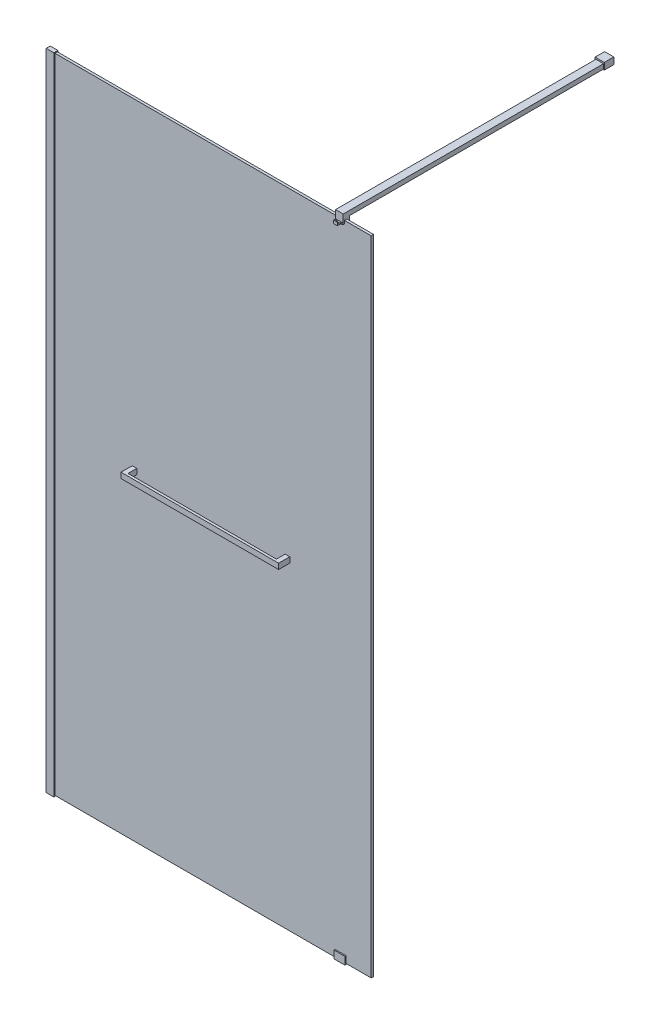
ISO-10303-21;
HEADER;
FILE_DESCRIPTION(('STEP AP214'),'2;1');
FILE_NAME('part.step','',(''),(''),'','','');
FILE_SCHEMA(('AUTOMOTIVE_DESIGN { 1 0 10303 214 1 1 1 1 }'));
ENDSEC;
DATA;
#1=APPLICATION_CONTEXT('core data for automotive mechanical design processes');
#2=APPLICATION_PROTOCOL_DEFINITION('international standard','automotive_design',2000,#1);
#3=PRODUCT_CONTEXT('',#1,'mechanical');
#4=PRODUCT('Part','Part','',(#3));
#5=PRODUCT_RELATED_PRODUCT_CATEGORY('part','',(#4));
#6=PRODUCT_DEFINITION_FORMATION('','',#4);
#7=PRODUCT_DEFINITION_CONTEXT('part definition',#1,'design');
#8=PRODUCT_DEFINITION('design','',#6,#7);
#9=PRODUCT_DEFINITION_SHAPE('','',#8);
#10=(LENGTH_UNIT() NAMED_UNIT(*) SI_UNIT(.MILLI.,.METRE.));
#11=(NAMED_UNIT(*) PLANE_ANGLE_UNIT() SI_UNIT($,.RADIAN.));
#12=(NAMED_UNIT(*) SI_UNIT($,.STERADIAN.) SOLID_ANGLE_UNIT());
#13=UNCERTAINTY_MEASURE_WITH_UNIT(LENGTH_MEASURE(1.E-05),#10,'distance_accuracy_value','');
#14=(GEOMETRIC_REPRESENTATION_CONTEXT(3) GLOBAL_UNCERTAINTY_ASSIGNED_CONTEXT((#13)) GLOBAL_UNIT_ASSIGNED_CONTEXT((#10,
#11,#12)) REPRESENTATION_CONTEXT('',''));
#15=CARTESIAN_POINT('',(0.,0.,0.));
#16=DIRECTION('',(0.,0.,1.));
#17=DIRECTION('',(1.,0.,0.));
#18=AXIS2_PLACEMENT_3D('',#15,#16,#17);
#19=CARTESIAN_POINT('',(792.45,1045.72,-21.6));
#20=DIRECTION('',(1.,0.,0.));
#21=DIRECTION('',(0.,0.,-1.));
#22=AXIS2_PLACEMENT_3D('',#19,#20,#21);
#23=PLANE('',#22);
#24=DIRECTION('',(0.,0.,-1.));
#25=VECTOR('',#24,1.);
#26=CARTESIAN_POINT('',(792.45,1053.72,-21.6));
#27=LINE('',#26,#25);
#28=CARTESIAN_POINT('',(792.45,1053.72,-21.6));
#29=VERTEX_POINT('',#28);
#30=CARTESIAN_POINT('',(792.45,1053.72,-101.6));
#31=VERTEX_POINT('',#30);
#32=EDGE_CURVE('E110',#29,#31,#27,.T.);
#33=ORIENTED_EDGE('',*,*,#32,.F.);
#34=DIRECTION('',(0.,1.,0.));
#35=VECTOR('',#34,1.);
#36=CARTESIAN_POINT('',(792.45,1045.72,-21.6));
#37=LINE('',#36,#35);
#38=CARTESIAN_POINT('',(792.45,1045.72,-21.6));
#39=VERTEX_POINT('',#38);
#40=EDGE_CURVE('E12',#39,#29,#37,.T.);
#41=ORIENTED_EDGE('',*,*,#40,.F.);
#42=DIRECTION('',(0.,0.,-1.));
#43=VECTOR('',#42,1.);
#44=CARTESIAN_POINT('',(792.45,1045.72,-21.6));
#45=LINE('',#44,#43);
#46=CARTESIAN_POINT('',(792.45,1045.72,-101.6));
#47=VERTEX_POINT('',#46);
#48=EDGE_CURVE('E104',#39,#47,#45,.T.);
#49=ORIENTED_EDGE('',*,*,#48,.T.);
#50=DIRECTION('',(0.,1.,0.));
#51=VECTOR('',#50,1.);
#52=CARTESIAN_POINT('',(792.45,1045.72,-101.6));
#53=LINE('',#52,#51);
#54=EDGE_CURVE('E49',#47,#31,#53,.T.);
#55=ORIENTED_EDGE('',*,*,#54,.T.);
#56=EDGE_LOOP('',(#33,#41,#49,#55));
#57=FACE_BOUND('',#56,.T.);
#58=ADVANCED_FACE('F46',(#57),#23,.T.);
#59=CARTESIAN_POINT('',(792.45,1045.72,-21.6));
#60=DIRECTION('',(0.,0.,1.));
#61=DIRECTION('',(1.,0.,0.));
#62=AXIS2_PLACEMENT_3D('',#59,#60,#61);
#63=PLANE('',#62);
#64=DIRECTION('',(1.,0.,0.));
#65=VECTOR('',#64,1.);
#66=CARTESIAN_POINT('',(792.45,1053.72,-21.6));
#67=LINE('',#66,#65);
#68=CARTESIAN_POINT('',(277.45,1053.72,-21.5999999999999));
#69=VERTEX_POINT('',#68);
#70=EDGE_CURVE('E106',#69,#29,#67,.T.);
#71=ORIENTED_EDGE('',*,*,#70,.F.);
#72=DIRECTION('',(0.,1.,0.));
#73=VECTOR('',#72,1.);
#74=CARTESIAN_POINT('',(277.45,1045.72,-21.5999999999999));
#75=LINE('',#74,#73);
#76=CARTESIAN_POINT('',(277.45,1045.72,-21.5999999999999));
#77=VERTEX_POINT('',#76);
#78=EDGE_CURVE('E55',#77,#69,#75,.T.);
#79=ORIENTED_EDGE('',*,*,#78,.F.);
#80=DIRECTION('',(1.,0.,0.));
#81=VECTOR('',#80,1.);
#82=CARTESIAN_POINT('',(792.45,1045.72,-21.6));
#83=LINE('',#82,#81);
#84=EDGE_CURVE('E101',#77,#39,#83,.T.);
#85=ORIENTED_EDGE('',*,*,#84,.T.);
#86=ORIENTED_EDGE('',*,*,#40,.T.);
#87=EDGE_LOOP('',(#71,#79,#85,#86));
#88=FACE_BOUND('',#87,.T.);
#89=ADVANCED_FACE('F120',(#88),#63,.T.);
#90=CARTESIAN_POINT('',(277.45,1045.72,-21.5999999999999));
#91=DIRECTION('',(-1.,0.,0.));
#92=DIRECTION('',(0.,0.,1.));
#93=AXIS2_PLACEMENT_3D('',#90,#91,#92);
#94=PLANE('',#93);
#95=DIRECTION('',(0.,0.,1.));
#96=VECTOR('',#95,1.);
#97=CARTESIAN_POINT('',(277.45,1053.72,-21.5999999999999));
#98=LINE('',#97,#96);
#99=CARTESIAN_POINT('',(277.45,1053.72,-101.6));
#100=VERTEX_POINT('',#99);
#101=EDGE_CURVE('E96',#100,#69,#98,.T.);
#102=ORIENTED_EDGE('',*,*,#101,.F.);
#103=DIRECTION('',(0.,1.,0.));
#104=VECTOR('',#103,1.);
#105=CARTESIAN_POINT('',(277.45,1045.72,-101.6));
#106=LINE('',#105,#104);
#107=CARTESIAN_POINT('',(277.45,1045.72,-101.6));
#108=VERTEX_POINT('',#107);
#109=EDGE_CURVE('E91',#108,#100,#106,.T.);
#110=ORIENTED_EDGE('',*,*,#109,.F.);
#111=DIRECTION('',(0.,0.,1.));
#112=VECTOR('',#111,1.);
#113=CARTESIAN_POINT('',(277.45,1045.72,-21.5999999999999));
#114=LINE('',#113,#112);
#115=EDGE_CURVE('E94',#108,#77,#114,.T.);
#116=ORIENTED_EDGE('',*,*,#115,.T.);
#117=ORIENTED_EDGE('',*,*,#78,.T.);
#118=EDGE_LOOP('',(#102,#110,#116,#117));
#119=FACE_BOUND('',#118,.T.);
#120=ADVANCED_FACE('F93',(#119),#94,.T.);
#121=CARTESIAN_POINT('',(792.45,1045.72,-101.6));
#122=DIRECTION('',(0.,0.,-1.));
#123=DIRECTION('',(-1.,0.,0.));
#124=AXIS2_PLACEMENT_3D('',#121,#122,#123);
#125=PLANE('',#124);
#126=DIRECTION('',(-1.,0.,0.));
#127=VECTOR('',#126,1.);
#128=CARTESIAN_POINT('',(792.45,1053.72,-101.6));
#129=LINE('',#128,#127);
#130=EDGE_CURVE('E113',#31,#100,#129,.T.);
#131=ORIENTED_EDGE('',*,*,#130,.F.);
#132=ORIENTED_EDGE('',*,*,#54,.F.);
#133=DIRECTION('',(-1.,0.,0.));
#134=VECTOR('',#133,1.);
#135=CARTESIAN_POINT('',(792.45,1045.72,-101.6));
#136=LINE('',#135,#134);
#137=EDGE_CURVE('E100',#47,#108,#136,.T.);
#138=ORIENTED_EDGE('',*,*,#137,.T.);
#139=ORIENTED_EDGE('',*,*,#109,.T.);
#140=EDGE_LOOP('',(#131,#132,#138,#139));
#141=FACE_BOUND('',#140,.T.);
#142=ADVANCED_FACE('F103',(#141),#125,.T.);
#143=CARTESIAN_POINT('',(792.45,1045.72,-101.6));
#144=DIRECTION('',(0.,1.,0.));
#145=DIRECTION('',(0.,0.,1.));
#146=AXIS2_PLACEMENT_3D('',#143,#144,#145);
#147=PLANE('',#146);
#148=ORIENTED_EDGE('',*,*,#48,.F.);
#149=ORIENTED_EDGE('',*,*,#84,.F.);
#150=ORIENTED_EDGE('',*,*,#115,.F.);
#151=ORIENTED_EDGE('',*,*,#137,.F.);
#152=EDGE_LOOP('',(#148,#149,#150,#151));
#153=FACE_BOUND('',#152,.T.);
#154=ADVANCED_FACE('F99',(#153),#147,.F.);
#155=CARTESIAN_POINT('',(792.45,1053.72,-101.6));
#156=DIRECTION('',(0.,1.,0.));
#157=DIRECTION('',(0.,0.,1.));
#158=AXIS2_PLACEMENT_3D('',#155,#156,#157);
#159=PLANE('',#158);
#160=ORIENTED_EDGE('',*,*,#32,.T.);
#161=ORIENTED_EDGE('',*,*,#130,.T.);
#162=ORIENTED_EDGE('',*,*,#101,.T.);
#163=ORIENTED_EDGE('',*,*,#70,.T.);
#164=EDGE_LOOP('',(#160,#161,#162,#163));
#165=FACE_BOUND('',#164,.T.);
#166=ADVANCED_FACE('F119',(#165),#159,.T.);
#167=CLOSED_SHELL('',(#58,#89,#120,#142,#154,#166));
#168=MANIFOLD_SOLID_BREP('B2',#167);
#169=CARTESIAN_POINT('',(292.45,1041.,-34.4));
#170=DIRECTION('',(0.,0.,1.));
#171=DIRECTION('',(1.,0.,0.));
#172=AXIS2_PLACEMENT_3D('',#169,#170,#171);
#173=PLANE('',#172);
#174=DIRECTION('',(0.,-1.,0.));
#175=VECTOR('',#174,1.);
#176=CARTESIAN_POINT('',(277.45,1059.,-34.4));
#177=LINE('',#176,#175);
#178=CARTESIAN_POINT('',(277.45,1045.73,-34.4));
#179=VERTEX_POINT('',#178);
#180=CARTESIAN_POINT('',(277.45,1041.,-34.4));
#181=VERTEX_POINT('',#180);
#182=EDGE_CURVE('E415',#179,#181,#177,.T.);
#183=ORIENTED_EDGE('',*,*,#182,.F.);
#184=DIRECTION('',(1.,0.,0.));
#185=VECTOR('',#184,1.);
#186=CARTESIAN_POINT('',(292.45,1045.73,-34.4));
#187=LINE('',#186,#185);
#188=CARTESIAN_POINT('',(292.45,1045.73,-34.4));
#189=VERTEX_POINT('',#188);
#190=EDGE_CURVE('E44',#179,#189,#187,.T.);
#191=ORIENTED_EDGE('',*,*,#190,.T.);
#192=DIRECTION('',(0.,1.,0.));
#193=VECTOR('',#192,1.);
#194=CARTESIAN_POINT('',(292.45,1059.,-34.4));
#195=LINE('',#194,#193);
#196=CARTESIAN_POINT('',(292.45,1041.,-34.4));
#197=VERTEX_POINT('',#196);
#198=EDGE_CURVE('E420',#197,#189,#195,.T.);
#199=ORIENTED_EDGE('',*,*,#198,.F.);
#200=DIRECTION('',(1.,0.,0.));
#201=VECTOR('',#200,1.);
#202=CARTESIAN_POINT('',(277.45,1041.,-34.4));
#203=LINE('',#202,#201);
#204=EDGE_CURVE('E394',#181,#197,#203,.T.);
#205=ORIENTED_EDGE('',*,*,#204,.F.);
#206=EDGE_LOOP('',(#183,#191,#199,#205));
#207=FACE_BOUND('',#206,.T.);
#208=ADVANCED_FACE('F180',(#207),#173,.F.);
#209=CARTESIAN_POINT('',(292.45,1059.,-34.4));
#210=DIRECTION('',(1.,0.,0.));
#211=DIRECTION('',(0.,0.,-1.));
#212=AXIS2_PLACEMENT_3D('',#209,#210,#211);
#213=PLANE('',#212);
#214=DIRECTION('',(0.,1.,0.));
#215=VECTOR('',#214,1.);
#216=CARTESIAN_POINT('',(292.45,1059.,25.1));
#217=LINE('',#216,#215);
#218=CARTESIAN_POINT('',(292.45,1041.,25.1));
#219=VERTEX_POINT('',#218);
#220=CARTESIAN_POINT('',(292.45,1059.,25.1));
#221=VERTEX_POINT('',#220);
#222=EDGE_CURVE('E198',#219,#221,#217,.T.);
#223=ORIENTED_EDGE('',*,*,#222,.F.);
#224=DIRECTION('',(0.,0.,1.));
#225=VECTOR('',#224,1.);
#226=CARTESIAN_POINT('',(292.45,1041.,-34.4));
#227=LINE('',#226,#225);
#228=EDGE_CURVE('E385',#197,#219,#227,.T.);
#229=ORIENTED_EDGE('',*,*,#228,.F.);
#230=ORIENTED_EDGE('',*,*,#198,.T.);
#231=DIRECTION('',(0.,0.,-1.));
#232=VECTOR('',#231,1.);
#233=CARTESIAN_POINT('',(292.45,1045.73,-34.4));
#234=LINE('',#233,#232);
#235=CARTESIAN_POINT('',(292.45,1045.73,-21.6));
#236=VERTEX_POINT('',#235);
#237=EDGE_CURVE('E433',#236,#189,#234,.T.);
#238=ORIENTED_EDGE('',*,*,#237,.F.);
#239=DIRECTION('',(0.,-1.,0.));
#240=VECTOR('',#239,1.);
#241=CARTESIAN_POINT('',(292.45,1059.,-21.6));
#242=LINE('',#241,#240);
#243=CARTESIAN_POINT('',(292.45,1053.73,-21.6));
#244=VERTEX_POINT('',#243);
#245=EDGE_CURVE('E431',#244,#236,#242,.T.);
#246=ORIENTED_EDGE('',*,*,#245,.F.);
#247=DIRECTION('',(0.,0.,1.));
#248=VECTOR('',#247,1.);
#249=CARTESIAN_POINT('',(292.45,1053.73,-34.4));
#250=LINE('',#249,#248);
#251=CARTESIAN_POINT('',(292.45,1053.73,-34.4));
#252=VERTEX_POINT('',#251);
#253=EDGE_CURVE('E435',#252,#244,#250,.T.);
#254=ORIENTED_EDGE('',*,*,#253,.F.);
#255=CARTESIAN_POINT('',(292.45,1059.,-34.4));
#256=VERTEX_POINT('',#255);
#257=EDGE_CURVE('E408',#252,#256,#195,.T.);
#258=ORIENTED_EDGE('',*,*,#257,.T.);
#259=DIRECTION('',(0.,0.,1.));
#260=VECTOR('',#259,1.);
#261=CARTESIAN_POINT('',(292.45,1059.,-34.4));
#262=LINE('',#261,#260);
#263=EDGE_CURVE('E389',#256,#221,#262,.T.);
#264=ORIENTED_EDGE('',*,*,#263,.T.);
#265=EDGE_LOOP('',(#223,#229,#230,#238,#246,#254,#258,#264));
#266=FACE_BOUND('',#265,.T.);
#267=ADVANCED_FACE('F182',(#266),#213,.T.);
#268=CARTESIAN_POINT('',(277.45,1041.,-34.4));
#269=DIRECTION('',(0.,-1.,0.));
#270=DIRECTION('',(0.,0.,-1.));
#271=AXIS2_PLACEMENT_3D('',#268,#269,#270);
#272=PLANE('',#271);
#273=ORIENTED_EDGE('',*,*,#228,.T.);
#274=DIRECTION('',(-1.,0.,0.));
#275=VECTOR('',#274,1.);
#276=CARTESIAN_POINT('',(797.147715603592,1041.,25.1));
#277=LINE('',#276,#275);
#278=CARTESIAN_POINT('',(777.45,1041.,25.1));
#279=VERTEX_POINT('',#278);
#280=EDGE_CURVE('E373',#279,#219,#277,.T.);
#281=ORIENTED_EDGE('',*,*,#280,.F.);
#282=DIRECTION('',(0.,0.,1.));
#283=VECTOR('',#282,1.);
#284=CARTESIAN_POINT('',(777.45,1041.,-34.4));
#285=LINE('',#284,#283);
#286=CARTESIAN_POINT('',(777.45,1041.,-34.4));
#287=VERTEX_POINT('',#286);
#288=EDGE_CURVE('E352',#287,#279,#285,.T.);
#289=ORIENTED_EDGE('',*,*,#288,.F.);
#290=DIRECTION('',(1.,0.,0.));
#291=VECTOR('',#290,1.);
#292=CARTESIAN_POINT('',(777.45,1041.,-34.4));
#293=LINE('',#292,#291);
#294=CARTESIAN_POINT('',(792.45,1041.,-34.4));
#295=VERTEX_POINT('',#294);
#296=EDGE_CURVE('E344',#287,#295,#293,.T.);
#297=ORIENTED_EDGE('',*,*,#296,.T.);
#298=DIRECTION('',(0.,0.,1.));
#299=VECTOR('',#298,1.);
#300=CARTESIAN_POINT('',(792.45,1041.,-34.4));
#301=LINE('',#300,#299);
#302=CARTESIAN_POINT('',(792.45,1041.,33.1));
#303=VERTEX_POINT('',#302);
#304=EDGE_CURVE('E348',#295,#303,#301,.T.);
#305=ORIENTED_EDGE('',*,*,#304,.T.);
#306=DIRECTION('',(1.,0.,0.));
#307=VECTOR('',#306,1.);
#308=CARTESIAN_POINT('',(277.45,1041.,33.1));
#309=LINE('',#308,#307);
#310=CARTESIAN_POINT('',(277.45,1041.,33.1));
#311=VERTEX_POINT('',#310);
#312=EDGE_CURVE('E423',#311,#303,#309,.T.);
#313=ORIENTED_EDGE('',*,*,#312,.F.);
#314=DIRECTION('',(0.,0.,1.));
#315=VECTOR('',#314,1.);
#316=CARTESIAN_POINT('',(277.45,1041.,-34.4));
#317=LINE('',#316,#315);
#318=EDGE_CURVE('E388',#181,#311,#317,.T.);
#319=ORIENTED_EDGE('',*,*,#318,.F.);
#320=ORIENTED_EDGE('',*,*,#204,.T.);
#321=EDGE_LOOP('',(#273,#281,#289,#297,#305,#313,#319,#320));
#322=FACE_BOUND('',#321,.T.);
#323=ADVANCED_FACE('F456',(#322),#272,.T.);
#324=CARTESIAN_POINT('',(277.45,1059.,-34.4));
#325=DIRECTION('',(-1.,0.,0.));
#326=DIRECTION('',(0.,0.,1.));
#327=AXIS2_PLACEMENT_3D('',#324,#325,#326);
#328=PLANE('',#327);
#329=DIRECTION('',(0.,0.,1.));
#330=VECTOR('',#329,1.);
#331=CARTESIAN_POINT('',(277.45,1045.73,-34.4));
#332=LINE('',#331,#330);
#333=CARTESIAN_POINT('',(277.45,1045.73,-21.6));
#334=VERTEX_POINT('',#333);
#335=EDGE_CURVE('E379',#179,#334,#332,.T.);
#336=ORIENTED_EDGE('',*,*,#335,.F.);
#337=ORIENTED_EDGE('',*,*,#182,.T.);
#338=ORIENTED_EDGE('',*,*,#318,.T.);
#339=DIRECTION('',(0.,-1.,0.));
#340=VECTOR('',#339,1.);
#341=CARTESIAN_POINT('',(277.45,1059.,33.1));
#342=LINE('',#341,#340);
#343=CARTESIAN_POINT('',(277.45,1059.,33.1));
#344=VERTEX_POINT('',#343);
#345=EDGE_CURVE('E425',#344,#311,#342,.T.);
#346=ORIENTED_EDGE('',*,*,#345,.F.);
#347=DIRECTION('',(0.,0.,1.));
#348=VECTOR('',#347,1.);
#349=CARTESIAN_POINT('',(277.45,1059.,-34.4));
#350=LINE('',#349,#348);
#351=CARTESIAN_POINT('',(277.45,1059.,-34.4));
#352=VERTEX_POINT('',#351);
#353=EDGE_CURVE('E397',#352,#344,#350,.T.);
#354=ORIENTED_EDGE('',*,*,#353,.F.);
#355=CARTESIAN_POINT('',(277.45,1053.73,-34.4));
#356=VERTEX_POINT('',#355);
#357=EDGE_CURVE('E406',#352,#356,#177,.T.);
#358=ORIENTED_EDGE('',*,*,#357,.T.);
#359=DIRECTION('',(0.,0.,-1.));
#360=VECTOR('',#359,1.);
#361=CARTESIAN_POINT('',(277.45,1053.73,-34.4));
#362=LINE('',#361,#360);
#363=CARTESIAN_POINT('',(277.45,1053.73,-21.6));
#364=VERTEX_POINT('',#363);
#365=EDGE_CURVE('E206',#364,#356,#362,.T.);
#366=ORIENTED_EDGE('',*,*,#365,.F.);
#367=DIRECTION('',(0.,1.,0.));
#368=VECTOR('',#367,1.);
#369=CARTESIAN_POINT('',(277.45,1053.73,-21.6));
#370=LINE('',#369,#368);
#371=EDGE_CURVE('E442',#334,#364,#370,.T.);
#372=ORIENTED_EDGE('',*,*,#371,.F.);
#373=EDGE_LOOP('',(#336,#337,#338,#346,#354,#358,#366,#372));
#374=FACE_BOUND('',#373,.T.);
#375=ADVANCED_FACE('F412',(#374),#328,.T.);
#376=CARTESIAN_POINT('',(277.45,1059.,-34.4));
#377=DIRECTION('',(0.,1.,0.));
#378=DIRECTION('',(0.,0.,1.));
#379=AXIS2_PLACEMENT_3D('',#376,#377,#378);
#380=PLANE('',#379);
#381=ORIENTED_EDGE('',*,*,#353,.T.);
#382=DIRECTION('',(-1.,0.,0.));
#383=VECTOR('',#382,1.);
#384=CARTESIAN_POINT('',(277.45,1059.,33.1));
#385=LINE('',#384,#383);
#386=CARTESIAN_POINT('',(792.45,1059.,33.1));
#387=VERTEX_POINT('',#386);
#388=EDGE_CURVE('E428',#387,#344,#385,.T.);
#389=ORIENTED_EDGE('',*,*,#388,.F.);
#390=DIRECTION('',(0.,0.,1.));
#391=VECTOR('',#390,1.);
#392=CARTESIAN_POINT('',(792.45,1059.,-34.4));
#393=LINE('',#392,#391);
#394=CARTESIAN_POINT('',(792.45,1059.,-34.4));
#395=VERTEX_POINT('',#394);
#396=EDGE_CURVE('E347',#395,#387,#393,.T.);
#397=ORIENTED_EDGE('',*,*,#396,.F.);
#398=DIRECTION('',(-1.,0.,0.));
#399=VECTOR('',#398,1.);
#400=CARTESIAN_POINT('',(777.45,1059.,-34.4));
#401=LINE('',#400,#399);
#402=CARTESIAN_POINT('',(777.45,1059.,-34.4));
#403=VERTEX_POINT('',#402);
#404=EDGE_CURVE('E337',#395,#403,#401,.T.);
#405=ORIENTED_EDGE('',*,*,#404,.T.);
#406=DIRECTION('',(0.,0.,1.));
#407=VECTOR('',#406,1.);
#408=CARTESIAN_POINT('',(777.45,1059.,-34.4));
#409=LINE('',#408,#407);
#410=CARTESIAN_POINT('',(777.45,1059.,25.1));
#411=VERTEX_POINT('',#410);
#412=EDGE_CURVE('E360',#403,#411,#409,.T.);
#413=ORIENTED_EDGE('',*,*,#412,.T.);
#414=DIRECTION('',(-1.,0.,0.));
#415=VECTOR('',#414,1.);
#416=CARTESIAN_POINT('',(797.147715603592,1059.,25.1));
#417=LINE('',#416,#415);
#418=EDGE_CURVE('E370',#411,#221,#417,.T.);
#419=ORIENTED_EDGE('',*,*,#418,.T.);
#420=ORIENTED_EDGE('',*,*,#263,.F.);
#421=DIRECTION('',(-1.,0.,0.));
#422=VECTOR('',#421,1.);
#423=CARTESIAN_POINT('',(277.45,1059.,-34.4));
#424=LINE('',#423,#422);
#425=EDGE_CURVE('E417',#256,#352,#424,.T.);
#426=ORIENTED_EDGE('',*,*,#425,.T.);
#427=EDGE_LOOP('',(#381,#389,#397,#405,#413,#419,#420,#426));
#428=FACE_BOUND('',#427,.T.);
#429=ADVANCED_FACE('F463',(#428),#380,.T.);
#430=ORIENTED_EDGE('',*,*,#257,.F.);
#431=DIRECTION('',(-1.,0.,0.));
#432=VECTOR('',#431,1.);
#433=CARTESIAN_POINT('',(292.45,1053.73,-34.4));
#434=LINE('',#433,#432);
#435=EDGE_CURVE('E190',#252,#356,#434,.T.);
#436=ORIENTED_EDGE('',*,*,#435,.T.);
#437=ORIENTED_EDGE('',*,*,#357,.F.);
#438=ORIENTED_EDGE('',*,*,#425,.F.);
#439=EDGE_LOOP('',(#430,#436,#437,#438));
#440=FACE_BOUND('',#439,.T.);
#441=ADVANCED_FACE('F404',(#440),#173,.F.);
#442=CARTESIAN_POINT('',(292.45,1041.,33.1));
#443=DIRECTION('',(0.,0.,1.));
#444=DIRECTION('',(1.,0.,0.));
#445=AXIS2_PLACEMENT_3D('',#442,#443,#444);
#446=PLANE('',#445);
#447=ORIENTED_EDGE('',*,*,#312,.T.);
#448=DIRECTION('',(0.,1.,0.));
#449=VECTOR('',#448,1.);
#450=CARTESIAN_POINT('',(792.45,1059.,33.1));
#451=LINE('',#450,#449);
#452=EDGE_CURVE('E332',#303,#387,#451,.T.);
#453=ORIENTED_EDGE('',*,*,#452,.T.);
#454=ORIENTED_EDGE('',*,*,#388,.T.);
#455=ORIENTED_EDGE('',*,*,#345,.T.);
#456=EDGE_LOOP('',(#447,#453,#454,#455));
#457=FACE_BOUND('',#456,.T.);
#458=ADVANCED_FACE('F459',(#457),#446,.T.);
#459=CARTESIAN_POINT('',(807.544369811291,1045.73,-34.4));
#460=DIRECTION('',(0.,-1.,0.));
#461=DIRECTION('',(0.,0.,-1.));
#462=AXIS2_PLACEMENT_3D('',#459,#460,#461);
#463=PLANE('',#462);
#464=ORIENTED_EDGE('',*,*,#237,.T.);
#465=ORIENTED_EDGE('',*,*,#190,.F.);
#466=ORIENTED_EDGE('',*,*,#335,.T.);
#467=DIRECTION('',(-1.,0.,0.));
#468=VECTOR('',#467,1.);
#469=CARTESIAN_POINT('',(807.544369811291,1045.73,-21.6));
#470=LINE('',#469,#468);
#471=EDGE_CURVE('E438',#236,#334,#470,.T.);
#472=ORIENTED_EDGE('',*,*,#471,.F.);
#473=EDGE_LOOP('',(#464,#465,#466,#472));
#474=FACE_BOUND('',#473,.T.);
#475=ADVANCED_FACE('F498',(#474),#463,.F.);
#476=CARTESIAN_POINT('',(807.544369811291,1053.73,-21.6));
#477=DIRECTION('',(0.,0.,1.));
#478=DIRECTION('',(1.,0.,0.));
#479=AXIS2_PLACEMENT_3D('',#476,#477,#478);
#480=PLANE('',#479);
#481=ORIENTED_EDGE('',*,*,#245,.T.);
#482=ORIENTED_EDGE('',*,*,#471,.T.);
#483=ORIENTED_EDGE('',*,*,#371,.T.);
#484=DIRECTION('',(-1.,0.,0.));
#485=VECTOR('',#484,1.);
#486=CARTESIAN_POINT('',(807.544369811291,1053.73,-21.6));
#487=LINE('',#486,#485);
#488=EDGE_CURVE('E437',#244,#364,#487,.T.);
#489=ORIENTED_EDGE('',*,*,#488,.F.);
#490=EDGE_LOOP('',(#481,#482,#483,#489));
#491=FACE_BOUND('',#490,.T.);
#492=ADVANCED_FACE('F446',(#491),#480,.F.);
#493=CARTESIAN_POINT('',(807.544369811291,1053.73,-34.4));
#494=DIRECTION('',(0.,1.,0.));
#495=DIRECTION('',(0.,0.,1.));
#496=AXIS2_PLACEMENT_3D('',#493,#494,#495);
#497=PLANE('',#496);
#498=ORIENTED_EDGE('',*,*,#253,.T.);
#499=ORIENTED_EDGE('',*,*,#488,.T.);
#500=ORIENTED_EDGE('',*,*,#365,.T.);
#501=ORIENTED_EDGE('',*,*,#435,.F.);
#502=EDGE_LOOP('',(#498,#499,#500,#501));
#503=FACE_BOUND('',#502,.T.);
#504=ADVANCED_FACE('F538',(#503),#497,.F.);
#505=CARTESIAN_POINT('',(797.147715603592,1059.,25.1));
#506=DIRECTION('',(0.,0.,1.));
#507=DIRECTION('',(0.,-1.,0.));
#508=AXIS2_PLACEMENT_3D('',#505,#506,#507);
#509=PLANE('',#508);
#510=ORIENTED_EDGE('',*,*,#418,.F.);
#511=DIRECTION('',(0.,-1.,0.));
#512=VECTOR('',#511,1.);
#513=CARTESIAN_POINT('',(777.45,1059.,25.1));
#514=LINE('',#513,#512);
#515=EDGE_CURVE('E184',#411,#279,#514,.T.);
#516=ORIENTED_EDGE('',*,*,#515,.T.);
#517=ORIENTED_EDGE('',*,*,#280,.T.);
#518=ORIENTED_EDGE('',*,*,#222,.T.);
#519=EDGE_LOOP('',(#510,#516,#517,#518));
#520=FACE_BOUND('',#519,.T.);
#521=ADVANCED_FACE('F470',(#520),#509,.F.);
#522=CARTESIAN_POINT('',(777.45,1059.,-34.4));
#523=DIRECTION('',(-1.,0.,0.));
#524=DIRECTION('',(0.,0.,1.));
#525=AXIS2_PLACEMENT_3D('',#522,#523,#524);
#526=PLANE('',#525);
#527=ORIENTED_EDGE('',*,*,#515,.F.);
#528=ORIENTED_EDGE('',*,*,#412,.F.);
#529=DIRECTION('',(0.,-1.,0.));
#530=VECTOR('',#529,1.);
#531=CARTESIAN_POINT('',(777.45,1059.,-34.4));
#532=LINE('',#531,#530);
#533=CARTESIAN_POINT('',(777.45,1053.73,-34.4));
#534=VERTEX_POINT('',#533);
#535=EDGE_CURVE('E341',#403,#534,#532,.T.);
#536=ORIENTED_EDGE('',*,*,#535,.T.);
#537=DIRECTION('',(0.,0.,-1.));
#538=VECTOR('',#537,1.);
#539=CARTESIAN_POINT('',(777.45,1053.73,-34.4));
#540=LINE('',#539,#538);
#541=CARTESIAN_POINT('',(777.45,1053.73,-21.6));
#542=VERTEX_POINT('',#541);
#543=EDGE_CURVE('E329',#542,#534,#540,.T.);
#544=ORIENTED_EDGE('',*,*,#543,.F.);
#545=DIRECTION('',(0.,1.,0.));
#546=VECTOR('',#545,1.);
#547=CARTESIAN_POINT('',(777.45,1059.,-21.6));
#548=LINE('',#547,#546);
#549=CARTESIAN_POINT('',(777.45,1045.73,-21.6));
#550=VERTEX_POINT('',#549);
#551=EDGE_CURVE('E351',#550,#542,#548,.T.);
#552=ORIENTED_EDGE('',*,*,#551,.F.);
#553=DIRECTION('',(0.,0.,1.));
#554=VECTOR('',#553,1.);
#555=CARTESIAN_POINT('',(777.45,1045.73,-34.4));
#556=LINE('',#555,#554);
#557=CARTESIAN_POINT('',(777.45,1045.73,-34.4));
#558=VERTEX_POINT('',#557);
#559=EDGE_CURVE('E313',#558,#550,#556,.T.);
#560=ORIENTED_EDGE('',*,*,#559,.F.);
#561=EDGE_CURVE('E340',#558,#287,#532,.T.);
#562=ORIENTED_EDGE('',*,*,#561,.T.);
#563=ORIENTED_EDGE('',*,*,#288,.T.);
#564=EDGE_LOOP('',(#527,#528,#536,#544,#552,#560,#562,#563));
#565=FACE_BOUND('',#564,.T.);
#566=ADVANCED_FACE('F471',(#565),#526,.T.);
#567=CARTESIAN_POINT('',(792.45,1041.,-34.4));
#568=DIRECTION('',(0.,0.,1.));
#569=DIRECTION('',(1.,0.,0.));
#570=AXIS2_PLACEMENT_3D('',#567,#568,#569);
#571=PLANE('',#570);
#572=ORIENTED_EDGE('',*,*,#561,.F.);
#573=DIRECTION('',(-1.,0.,0.));
#574=VECTOR('',#573,1.);
#575=CARTESIAN_POINT('',(807.544369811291,1045.73,-34.4));
#576=LINE('',#575,#574);
#577=CARTESIAN_POINT('',(792.45,1045.73,-34.4));
#578=VERTEX_POINT('',#577);
#579=EDGE_CURVE('E326',#578,#558,#576,.T.);
#580=ORIENTED_EDGE('',*,*,#579,.F.);
#581=DIRECTION('',(0.,1.,0.));
#582=VECTOR('',#581,1.);
#583=CARTESIAN_POINT('',(792.45,1059.,-34.4));
#584=LINE('',#583,#582);
#585=EDGE_CURVE('E318',#295,#578,#584,.T.);
#586=ORIENTED_EDGE('',*,*,#585,.F.);
#587=ORIENTED_EDGE('',*,*,#296,.F.);
#588=EDGE_LOOP('',(#572,#580,#586,#587));
#589=FACE_BOUND('',#588,.T.);
#590=ADVANCED_FACE('F476',(#589),#571,.F.);
#591=CARTESIAN_POINT('',(792.45,1059.,-34.4));
#592=DIRECTION('',(1.,0.,0.));
#593=DIRECTION('',(0.,0.,-1.));
#594=AXIS2_PLACEMENT_3D('',#591,#592,#593);
#595=PLANE('',#594);
#596=DIRECTION('',(0.,0.,1.));
#597=VECTOR('',#596,1.);
#598=CARTESIAN_POINT('',(792.45,1045.73,-34.4));
#599=LINE('',#598,#597);
#600=CARTESIAN_POINT('',(792.45,1045.73,-21.6));
#601=VERTEX_POINT('',#600);
#602=EDGE_CURVE('E310',#578,#601,#599,.T.);
#603=ORIENTED_EDGE('',*,*,#602,.T.);
#604=DIRECTION('',(0.,1.,0.));
#605=VECTOR('',#604,1.);
#606=CARTESIAN_POINT('',(792.45,1053.73,-21.6));
#607=LINE('',#606,#605);
#608=CARTESIAN_POINT('',(792.45,1053.73,-21.6));
#609=VERTEX_POINT('',#608);
#610=EDGE_CURVE('E297',#601,#609,#607,.T.);
#611=ORIENTED_EDGE('',*,*,#610,.T.);
#612=DIRECTION('',(0.,0.,-1.));
#613=VECTOR('',#612,1.);
#614=CARTESIAN_POINT('',(792.45,1053.73,-34.4));
#615=LINE('',#614,#613);
#616=CARTESIAN_POINT('',(792.45,1053.73,-34.4));
#617=VERTEX_POINT('',#616);
#618=EDGE_CURVE('E321',#609,#617,#615,.T.);
#619=ORIENTED_EDGE('',*,*,#618,.T.);
#620=EDGE_CURVE('E335',#617,#395,#584,.T.);
#621=ORIENTED_EDGE('',*,*,#620,.T.);
#622=ORIENTED_EDGE('',*,*,#396,.T.);
#623=ORIENTED_EDGE('',*,*,#452,.F.);
#624=ORIENTED_EDGE('',*,*,#304,.F.);
#625=ORIENTED_EDGE('',*,*,#585,.T.);
#626=EDGE_LOOP('',(#603,#611,#619,#621,#622,#623,#624,#625));
#627=FACE_BOUND('',#626,.T.);
#628=ADVANCED_FACE('F316',(#627),#595,.T.);
#629=ORIENTED_EDGE('',*,*,#620,.F.);
#630=DIRECTION('',(-1.,0.,0.));
#631=VECTOR('',#630,1.);
#632=CARTESIAN_POINT('',(807.544369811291,1053.73,-34.4));
#633=LINE('',#632,#631);
#634=EDGE_CURVE('E322',#617,#534,#633,.T.);
#635=ORIENTED_EDGE('',*,*,#634,.T.);
#636=ORIENTED_EDGE('',*,*,#535,.F.);
#637=ORIENTED_EDGE('',*,*,#404,.F.);
#638=EDGE_LOOP('',(#629,#635,#636,#637));
#639=FACE_BOUND('',#638,.T.);
#640=ADVANCED_FACE('F467',(#639),#571,.F.);
#641=CARTESIAN_POINT('',(807.544369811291,1045.73,-34.4));
#642=DIRECTION('',(0.,-1.,0.));
#643=DIRECTION('',(0.,0.,-1.));
#644=AXIS2_PLACEMENT_3D('',#641,#642,#643);
#645=PLANE('',#644);
#646=ORIENTED_EDGE('',*,*,#559,.T.);
#647=DIRECTION('',(-1.,0.,0.));
#648=VECTOR('',#647,1.);
#649=CARTESIAN_POINT('',(807.544369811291,1045.73,-21.6));
#650=LINE('',#649,#648);
#651=EDGE_CURVE('E300',#601,#550,#650,.T.);
#652=ORIENTED_EDGE('',*,*,#651,.F.);
#653=ORIENTED_EDGE('',*,*,#602,.F.);
#654=ORIENTED_EDGE('',*,*,#579,.T.);
#655=EDGE_LOOP('',(#646,#652,#653,#654));
#656=FACE_BOUND('',#655,.T.);
#657=ADVANCED_FACE('F309',(#656),#645,.F.);
#658=CARTESIAN_POINT('',(807.544369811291,1053.73,-21.6));
#659=DIRECTION('',(0.,0.,1.));
#660=DIRECTION('',(1.,0.,0.));
#661=AXIS2_PLACEMENT_3D('',#658,#659,#660);
#662=PLANE('',#661);
#663=ORIENTED_EDGE('',*,*,#551,.T.);
#664=DIRECTION('',(-1.,0.,0.));
#665=VECTOR('',#664,1.);
#666=CARTESIAN_POINT('',(807.544369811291,1053.73,-21.6));
#667=LINE('',#666,#665);
#668=EDGE_CURVE('E303',#609,#542,#667,.T.);
#669=ORIENTED_EDGE('',*,*,#668,.F.);
#670=ORIENTED_EDGE('',*,*,#610,.F.);
#671=ORIENTED_EDGE('',*,*,#651,.T.);
#672=EDGE_LOOP('',(#663,#669,#670,#671));
#673=FACE_BOUND('',#672,.T.);
#674=ADVANCED_FACE('F299',(#673),#662,.F.);
#675=CARTESIAN_POINT('',(807.544369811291,1053.73,-34.4));
#676=DIRECTION('',(0.,1.,0.));
#677=DIRECTION('',(0.,0.,1.));
#678=AXIS2_PLACEMENT_3D('',#675,#676,#677);
#679=PLANE('',#678);
#680=ORIENTED_EDGE('',*,*,#543,.T.);
#681=ORIENTED_EDGE('',*,*,#634,.F.);
#682=ORIENTED_EDGE('',*,*,#618,.F.);
#683=ORIENTED_EDGE('',*,*,#668,.T.);
#684=EDGE_LOOP('',(#680,#681,#682,#683));
#685=FACE_BOUND('',#684,.T.);
#686=ADVANCED_FACE('F479',(#685),#679,.F.);
#687=CLOSED_SHELL('',(#208,#267,#323,#375,#429,#441,#458,#475,#492,#504,#521,#566,#590,#628,
#640,#657,#674,#686));
#688=MANIFOLD_SOLID_BREP('B6',#687);
#689=CARTESIAN_POINT('',(970.95,2090.,-19.4000000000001));
#690=DIRECTION('',(-1.,0.,0.));
#691=DIRECTION('',(0.,0.,1.));
#692=AXIS2_PLACEMENT_3D('',#689,#690,#691);
#693=PLANE('',#692);
#694=DIRECTION('',(0.,-1.,0.));
#695=VECTOR('',#694,1.);
#696=CARTESIAN_POINT('',(970.95,2090.,-850.03));
#697=LINE('',#696,#695);
#698=CARTESIAN_POINT('',(970.95,2120.,-850.03));
#699=VERTEX_POINT('',#698);
#700=CARTESIAN_POINT('',(970.95,2105.,-850.03));
#701=VERTEX_POINT('',#700);
#702=EDGE_CURVE('E669',#699,#701,#697,.T.);
#703=ORIENTED_EDGE('',*,*,#702,.F.);
#704=DIRECTION('',(0.,0.,1.));
#705=VECTOR('',#704,1.);
#706=CARTESIAN_POINT('',(970.95,2120.,0.599999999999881));
#707=LINE('',#706,#705);
#708=CARTESIAN_POINT('',(970.95,2120.,0.599999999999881));
#709=VERTEX_POINT('',#708);
#710=EDGE_CURVE('E994',#699,#709,#707,.T.);
#711=ORIENTED_EDGE('',*,*,#710,.T.);
#712=DIRECTION('',(0.,-1.,0.));
#713=VECTOR('',#712,1.);
#714=CARTESIAN_POINT('',(970.95,2094.,0.599999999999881));
#715=LINE('',#714,#713);
#716=CARTESIAN_POINT('',(970.95,2094.,0.599999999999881));
#717=VERTEX_POINT('',#716);
#718=EDGE_CURVE('E996',#709,#717,#715,.T.);
#719=ORIENTED_EDGE('',*,*,#718,.T.);
#720=DIRECTION('',(0.,1.,0.));
#721=VECTOR('',#720,1.);
#722=CARTESIAN_POINT('',(970.95,2090.,0.599999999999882));
#723=LINE('',#722,#721);
#724=CARTESIAN_POINT('',(970.95,2090.,0.599999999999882));
#725=VERTEX_POINT('',#724);
#726=EDGE_CURVE('E940',#725,#717,#723,.T.);
#727=ORIENTED_EDGE('',*,*,#726,.F.);
#728=DIRECTION('',(0.,0.,-1.));
#729=VECTOR('',#728,1.);
#730=CARTESIAN_POINT('',(970.95,2090.,-3.40000000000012));
#731=LINE('',#730,#729);
#732=CARTESIAN_POINT('',(970.95,2090.,-3.40000000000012));
#733=VERTEX_POINT('',#732);
#734=EDGE_CURVE('E970',#725,#733,#731,.T.);
#735=ORIENTED_EDGE('',*,*,#734,.T.);
#736=DIRECTION('',(0.,1.,-1.30407837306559E-13));
#737=VECTOR('',#736,1.);
#738=CARTESIAN_POINT('',(970.95,2100.,-3.40000000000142));
#739=LINE('',#738,#737);
#740=CARTESIAN_POINT('',(970.95,2100.,-3.40000000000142));
#741=VERTEX_POINT('',#740);
#742=EDGE_CURVE('E1000',#733,#741,#739,.T.);
#743=ORIENTED_EDGE('',*,*,#742,.T.);
#744=DIRECTION('',(0.,0.,-1.));
#745=VECTOR('',#744,1.);
#746=CARTESIAN_POINT('',(970.95,2100.,-11.4000000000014));
#747=LINE('',#746,#745);
#748=CARTESIAN_POINT('',(970.95,2100.,-11.4000000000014));
#749=VERTEX_POINT('',#748);
#750=EDGE_CURVE('E1002',#741,#749,#747,.T.);
#751=ORIENTED_EDGE('',*,*,#750,.T.);
#752=DIRECTION('',(0.,-1.,1.30451205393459E-13));
#753=VECTOR('',#752,1.);
#754=CARTESIAN_POINT('',(970.95,2090.,-11.4000000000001));
#755=LINE('',#754,#753);
#756=CARTESIAN_POINT('',(970.95,2090.,-11.4000000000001));
#757=VERTEX_POINT('',#756);
#758=EDGE_CURVE('E1003',#749,#757,#755,.T.);
#759=ORIENTED_EDGE('',*,*,#758,.T.);
#760=DIRECTION('',(0.,0.,-1.));
#761=VECTOR('',#760,1.);
#762=CARTESIAN_POINT('',(970.95,2090.,-19.4000000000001));
#763=LINE('',#762,#761);
#764=CARTESIAN_POINT('',(970.95,2090.,-19.4000000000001));
#765=VERTEX_POINT('',#764);
#766=EDGE_CURVE('E891',#757,#765,#763,.T.);
#767=ORIENTED_EDGE('',*,*,#766,.T.);
#768=DIRECTION('',(0.,1.,0.));
#769=VECTOR('',#768,1.);
#770=CARTESIAN_POINT('',(970.95,2120.,-19.4000000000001));
#771=LINE('',#770,#769);
#772=CARTESIAN_POINT('',(970.95,2105.,-19.4000000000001));
#773=VERTEX_POINT('',#772);
#774=EDGE_CURVE('E857',#765,#773,#771,.T.);
#775=ORIENTED_EDGE('',*,*,#774,.T.);
#776=DIRECTION('',(0.,0.,-1.));
#777=VECTOR('',#776,1.);
#778=CARTESIAN_POINT('',(970.95,2105.,-881.03));
#779=LINE('',#778,#777);
#780=EDGE_CURVE('E856',#773,#701,#779,.T.);
#781=ORIENTED_EDGE('',*,*,#780,.T.);
#782=EDGE_LOOP('',(#703,#711,#719,#727,#735,#743,#751,#759,#767,#775,#781));
#783=FACE_BOUND('',#782,.T.);
#784=ADVANCED_FACE('F654',(#783),#693,.F.);
#785=CARTESIAN_POINT('',(945.95,2090.,-19.4000000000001));
#786=DIRECTION('',(-1.,0.,0.));
#787=DIRECTION('',(0.,0.,1.));
#788=AXIS2_PLACEMENT_3D('',#785,#786,#787);
#789=PLANE('',#788);
#790=DIRECTION('',(0.,0.,1.));
#791=VECTOR('',#790,1.);
#792=CARTESIAN_POINT('',(945.95,2120.,0.599999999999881));
#793=LINE('',#792,#791);
#794=CARTESIAN_POINT('',(945.95,2120.,-850.03));
#795=VERTEX_POINT('',#794);
#796=CARTESIAN_POINT('',(945.95,2120.,0.599999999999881));
#797=VERTEX_POINT('',#796);
#798=EDGE_CURVE('E880',#795,#797,#793,.T.);
#799=ORIENTED_EDGE('',*,*,#798,.F.);
#800=DIRECTION('',(0.,-1.,0.));
#801=VECTOR('',#800,1.);
#802=CARTESIAN_POINT('',(945.95,2090.,-850.03));
#803=LINE('',#802,#801);
#804=CARTESIAN_POINT('',(945.95,2105.,-850.03));
#805=VERTEX_POINT('',#804);
#806=EDGE_CURVE('E838',#795,#805,#803,.T.);
#807=ORIENTED_EDGE('',*,*,#806,.T.);
#808=DIRECTION('',(0.,0.,1.));
#809=VECTOR('',#808,1.);
#810=CARTESIAN_POINT('',(945.95,2105.,-881.03));
#811=LINE('',#810,#809);
#812=CARTESIAN_POINT('',(945.95,2105.,-19.4000000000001));
#813=VERTEX_POINT('',#812);
#814=EDGE_CURVE('E846',#805,#813,#811,.T.);
#815=ORIENTED_EDGE('',*,*,#814,.T.);
#816=DIRECTION('',(0.,1.,0.));
#817=VECTOR('',#816,1.);
#818=CARTESIAN_POINT('',(945.95,2120.,-19.4000000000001));
#819=LINE('',#818,#817);
#820=CARTESIAN_POINT('',(945.95,2090.,-19.4000000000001));
#821=VERTEX_POINT('',#820);
#822=EDGE_CURVE('E870',#821,#813,#819,.T.);
#823=ORIENTED_EDGE('',*,*,#822,.F.);
#824=DIRECTION('',(0.,0.,-1.));
#825=VECTOR('',#824,1.);
#826=CARTESIAN_POINT('',(945.95,2090.,-19.4000000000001));
#827=LINE('',#826,#825);
#828=CARTESIAN_POINT('',(945.95,2090.,-11.4000000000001));
#829=VERTEX_POINT('',#828);
#830=EDGE_CURVE('E904',#829,#821,#827,.T.);
#831=ORIENTED_EDGE('',*,*,#830,.F.);
#832=DIRECTION('',(0.,-1.,1.30451205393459E-13));
#833=VECTOR('',#832,1.);
#834=CARTESIAN_POINT('',(945.95,2090.,-11.4000000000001));
#835=LINE('',#834,#833);
#836=CARTESIAN_POINT('',(945.95,2100.,-11.4000000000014));
#837=VERTEX_POINT('',#836);
#838=EDGE_CURVE('E902',#837,#829,#835,.T.);
#839=ORIENTED_EDGE('',*,*,#838,.F.);
#840=DIRECTION('',(0.,0.,-1.));
#841=VECTOR('',#840,1.);
#842=CARTESIAN_POINT('',(945.95,2100.,-11.4000000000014));
#843=LINE('',#842,#841);
#844=CARTESIAN_POINT('',(945.95,2100.,-3.40000000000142));
#845=VERTEX_POINT('',#844);
#846=EDGE_CURVE('E900',#845,#837,#843,.T.);
#847=ORIENTED_EDGE('',*,*,#846,.F.);
#848=DIRECTION('',(0.,1.,-1.30407837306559E-13));
#849=VECTOR('',#848,1.);
#850=CARTESIAN_POINT('',(945.95,2100.,-3.40000000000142));
#851=LINE('',#850,#849);
#852=CARTESIAN_POINT('',(945.95,2090.,-3.40000000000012));
#853=VERTEX_POINT('',#852);
#854=EDGE_CURVE('E898',#853,#845,#851,.T.);
#855=ORIENTED_EDGE('',*,*,#854,.F.);
#856=DIRECTION('',(0.,0.,-1.));
#857=VECTOR('',#856,1.);
#858=CARTESIAN_POINT('',(945.95,2090.,-3.40000000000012));
#859=LINE('',#858,#857);
#860=CARTESIAN_POINT('',(945.95,2090.,0.599999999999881));
#861=VERTEX_POINT('',#860);
#862=EDGE_CURVE('E896',#861,#853,#859,.T.);
#863=ORIENTED_EDGE('',*,*,#862,.F.);
#864=DIRECTION('',(0.,1.,0.));
#865=VECTOR('',#864,1.);
#866=CARTESIAN_POINT('',(945.95,2090.,0.599999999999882));
#867=LINE('',#866,#865);
#868=CARTESIAN_POINT('',(945.95,2094.,0.599999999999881));
#869=VERTEX_POINT('',#868);
#870=EDGE_CURVE('E937',#861,#869,#867,.T.);
#871=ORIENTED_EDGE('',*,*,#870,.T.);
#872=DIRECTION('',(0.,-1.,0.));
#873=VECTOR('',#872,1.);
#874=CARTESIAN_POINT('',(945.95,2094.,0.599999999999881));
#875=LINE('',#874,#873);
#876=EDGE_CURVE('E882',#797,#869,#875,.T.);
#877=ORIENTED_EDGE('',*,*,#876,.F.);
#878=EDGE_LOOP('',(#799,#807,#815,#823,#831,#839,#847,#855,#863,#871,#877));
#879=FACE_BOUND('',#878,.T.);
#880=ADVANCED_FACE('F867',(#879),#789,.T.);
#881=CARTESIAN_POINT('',(970.95,2120.,0.599999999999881));
#882=DIRECTION('',(0.,-1.,0.));
#883=DIRECTION('',(0.,0.,-1.));
#884=AXIS2_PLACEMENT_3D('',#881,#882,#883);
#885=PLANE('',#884);
#886=DIRECTION('',(1.,0.,0.));
#887=VECTOR('',#886,1.);
#888=CARTESIAN_POINT('',(970.95,2120.,-850.03));
#889=LINE('',#888,#887);
#890=EDGE_CURVE('E676',#795,#699,#889,.T.);
#891=ORIENTED_EDGE('',*,*,#890,.F.);
#892=ORIENTED_EDGE('',*,*,#798,.T.);
#893=DIRECTION('',(-1.,0.,0.));
#894=VECTOR('',#893,1.);
#895=CARTESIAN_POINT('',(970.95,2120.,0.599999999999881));
#896=LINE('',#895,#894);
#897=EDGE_CURVE('E934',#709,#797,#896,.T.);
#898=ORIENTED_EDGE('',*,*,#897,.F.);
#899=ORIENTED_EDGE('',*,*,#710,.F.);
#900=EDGE_LOOP('',(#891,#892,#898,#899));
#901=FACE_BOUND('',#900,.T.);
#902=ADVANCED_FACE('F1045',(#901),#885,.F.);
#903=CARTESIAN_POINT('',(945.95,2105.,-19.4000000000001));
#904=DIRECTION('',(0.,1.,0.));
#905=DIRECTION('',(0.,0.,1.));
#906=AXIS2_PLACEMENT_3D('',#903,#904,#905);
#907=PLANE('',#906);
#908=DIRECTION('',(-1.,0.,0.));
#909=VECTOR('',#908,1.);
#910=CARTESIAN_POINT('',(945.95,2105.,-850.03));
#911=LINE('',#910,#909);
#912=EDGE_CURVE('E178',#701,#805,#911,.T.);
#913=ORIENTED_EDGE('',*,*,#912,.F.);
#914=ORIENTED_EDGE('',*,*,#780,.F.);
#915=DIRECTION('',(1.,0.,0.));
#916=VECTOR('',#915,1.);
#917=CARTESIAN_POINT('',(945.95,2105.,-19.4000000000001));
#918=LINE('',#917,#916);
#919=EDGE_CURVE('E852',#813,#773,#918,.T.);
#920=ORIENTED_EDGE('',*,*,#919,.F.);
#921=ORIENTED_EDGE('',*,*,#814,.F.);
#922=EDGE_LOOP('',(#913,#914,#920,#921));
#923=FACE_BOUND('',#922,.T.);
#924=ADVANCED_FACE('F873',(#923),#907,.F.);
#925=CARTESIAN_POINT('',(970.95,2094.,9.84506801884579));
#926=DIRECTION('',(0.,-1.,0.));
#927=DIRECTION('',(0.,0.,-1.));
#928=AXIS2_PLACEMENT_3D('',#925,#926,#927);
#929=PLANE('',#928);
#930=DIRECTION('',(-0.906307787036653,0.,-0.422618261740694));
#931=VECTOR('',#930,1.);
#932=CARTESIAN_POINT('',(970.025911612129,2094.,11.8267819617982));
#933=LINE('',#932,#931);
#934=CARTESIAN_POINT('',(952.45,2094.,3.6309997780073));
#935=VERTEX_POINT('',#934);
#936=EDGE_CURVE('E973',#935,#869,#933,.T.);
#937=ORIENTED_EDGE('',*,*,#936,.F.);
#938=DIRECTION('',(0.,0.,-1.));
#939=VECTOR('',#938,1.);
#940=CARTESIAN_POINT('',(952.45,2094.,9.84506801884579));
#941=LINE('',#940,#939);
#942=CARTESIAN_POINT('',(952.45,2094.,9.84506801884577));
#943=VERTEX_POINT('',#942);
#944=EDGE_CURVE('E881',#943,#935,#941,.T.);
#945=ORIENTED_EDGE('',*,*,#944,.F.);
#946=DIRECTION('',(-1.,0.,0.));
#947=VECTOR('',#946,1.);
#948=CARTESIAN_POINT('',(970.95,2094.,9.84506801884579));
#949=LINE('',#948,#947);
#950=CARTESIAN_POINT('',(964.45,2094.,9.84506801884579));
#951=VERTEX_POINT('',#950);
#952=EDGE_CURVE('E928',#951,#943,#949,.T.);
#953=ORIENTED_EDGE('',*,*,#952,.F.);
#954=DIRECTION('',(0.,0.,1.));
#955=VECTOR('',#954,1.);
#956=CARTESIAN_POINT('',(964.45,2094.,9.84506801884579));
#957=LINE('',#956,#955);
#958=CARTESIAN_POINT('',(964.45,2094.,3.63099977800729));
#959=VERTEX_POINT('',#958);
#960=EDGE_CURVE('E987',#959,#951,#957,.T.);
#961=ORIENTED_EDGE('',*,*,#960,.F.);
#962=DIRECTION('',(-0.906307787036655,0.,0.422618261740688));
#963=VECTOR('',#962,1.);
#964=CARTESIAN_POINT('',(967.408933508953,2094.,2.25122642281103));
#965=LINE('',#964,#963);
#966=EDGE_CURVE('E972',#717,#959,#965,.T.);
#967=ORIENTED_EDGE('',*,*,#966,.F.);
#968=DIRECTION('',(-1.,0.,0.));
#969=VECTOR('',#968,1.);
#970=CARTESIAN_POINT('',(970.95,2094.,0.599999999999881));
#971=LINE('',#970,#969);
#972=EDGE_CURVE('E931',#717,#869,#971,.T.);
#973=ORIENTED_EDGE('',*,*,#972,.T.);
#974=EDGE_LOOP('',(#937,#945,#953,#961,#967,#973));
#975=FACE_BOUND('',#974,.T.);
#976=ADVANCED_FACE('F1032',(#975),#929,.F.);
#977=CARTESIAN_POINT('',(970.95,2100.,10.3700000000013));
#978=DIRECTION('',(0.,-0.087155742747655,0.996194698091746));
#979=DIRECTION('',(0.,-0.996194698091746,-0.087155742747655));
#980=AXIS2_PLACEMENT_3D('',#977,#978,#979);
#981=PLANE('',#980);
#982=DIRECTION('',(0.,-0.996194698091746,-0.087155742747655));
#983=VECTOR('',#982,1.);
#984=CARTESIAN_POINT('',(952.45,2100.,10.3700000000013));
#985=LINE('',#984,#983);
#986=CARTESIAN_POINT('',(952.45,2100.,10.3700000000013));
#987=VERTEX_POINT('',#986);
#988=EDGE_CURVE('E884',#987,#943,#985,.T.);
#989=ORIENTED_EDGE('',*,*,#988,.F.);
#990=DIRECTION('',(-1.,0.,0.));
#991=VECTOR('',#990,1.);
#992=CARTESIAN_POINT('',(970.95,2100.,10.3700000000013));
#993=LINE('',#992,#991);
#994=CARTESIAN_POINT('',(964.45,2100.,10.3700000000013));
#995=VERTEX_POINT('',#994);
#996=EDGE_CURVE('E925',#995,#987,#993,.T.);
#997=ORIENTED_EDGE('',*,*,#996,.F.);
#998=DIRECTION('',(0.,0.996194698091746,0.087155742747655));
#999=VECTOR('',#998,1.);
#1000=CARTESIAN_POINT('',(964.45,2100.,10.3700000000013));
#1001=LINE('',#1000,#999);
#1002=EDGE_CURVE('E984',#951,#995,#1001,.T.);
#1003=ORIENTED_EDGE('',*,*,#1002,.F.);
#1004=ORIENTED_EDGE('',*,*,#952,.T.);
#1005=EDGE_LOOP('',(#989,#997,#1003,#1004));
#1006=FACE_BOUND('',#1005,.T.);
#1007=ADVANCED_FACE('F1036',(#1006),#981,.F.);
#1008=CARTESIAN_POINT('',(970.95,2100.,13.3700000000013));
#1009=DIRECTION('',(0.,-1.,1.48029736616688E-13));
#1010=DIRECTION('',(0.,-1.48029736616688E-13,-1.));
#1011=AXIS2_PLACEMENT_3D('',#1008,#1009,#1010);
#1012=PLANE('',#1011);
#1013=DIRECTION('',(0.,-1.48029736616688E-13,-1.));
#1014=VECTOR('',#1013,1.);
#1015=CARTESIAN_POINT('',(952.45,2100.,13.3700000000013));
#1016=LINE('',#1015,#1014);
#1017=CARTESIAN_POINT('',(952.45,2100.,13.3700000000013));
#1018=VERTEX_POINT('',#1017);
#1019=EDGE_CURVE('E990',#1018,#987,#1016,.T.);
#1020=ORIENTED_EDGE('',*,*,#1019,.F.);
#1021=DIRECTION('',(-1.,0.,0.));
#1022=VECTOR('',#1021,1.);
#1023=CARTESIAN_POINT('',(970.95,2100.,13.3700000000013));
#1024=LINE('',#1023,#1022);
#1025=CARTESIAN_POINT('',(964.45,2100.,13.3700000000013));
#1026=VERTEX_POINT('',#1025);
#1027=EDGE_CURVE('E922',#1026,#1018,#1024,.T.);
#1028=ORIENTED_EDGE('',*,*,#1027,.F.);
#1029=DIRECTION('',(0.,1.48029736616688E-13,1.));
#1030=VECTOR('',#1029,1.);
#1031=CARTESIAN_POINT('',(964.45,2100.,13.3700000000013));
#1032=LINE('',#1031,#1030);
#1033=EDGE_CURVE('E976',#995,#1026,#1032,.T.);
#1034=ORIENTED_EDGE('',*,*,#1033,.F.);
#1035=ORIENTED_EDGE('',*,*,#996,.T.);
#1036=EDGE_LOOP('',(#1020,#1028,#1034,#1035));
#1037=FACE_BOUND('',#1036,.T.);
#1038=ADVANCED_FACE('F1039',(#1037),#1012,.F.);
#1039=CARTESIAN_POINT('',(970.95,2090.,13.3700000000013));
#1040=DIRECTION('',(0.,0.,-1.));
#1041=DIRECTION('',(0.,1.,0.));
#1042=AXIS2_PLACEMENT_3D('',#1039,#1040,#1041);
#1043=PLANE('',#1042);
#1044=ORIENTED_EDGE('',*,*,#1027,.T.);
#1045=DIRECTION('',(0.,-1.,0.));
#1046=VECTOR('',#1045,1.);
#1047=CARTESIAN_POINT('',(952.45,7694.31257189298,13.3700000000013));
#1048=LINE('',#1047,#1046);
#1049=CARTESIAN_POINT('',(952.45,2090.,13.3700000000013));
#1050=VERTEX_POINT('',#1049);
#1051=EDGE_CURVE('E953',#1018,#1050,#1048,.T.);
#1052=ORIENTED_EDGE('',*,*,#1051,.T.);
#1053=DIRECTION('',(-1.,0.,0.));
#1054=VECTOR('',#1053,1.);
#1055=CARTESIAN_POINT('',(970.95,2090.,13.3700000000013));
#1056=LINE('',#1055,#1054);
#1057=CARTESIAN_POINT('',(964.45,2090.,13.3700000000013));
#1058=VERTEX_POINT('',#1057);
#1059=EDGE_CURVE('E919',#1058,#1050,#1056,.T.);
#1060=ORIENTED_EDGE('',*,*,#1059,.F.);
#1061=DIRECTION('',(0.,-1.,0.));
#1062=VECTOR('',#1061,1.);
#1063=CARTESIAN_POINT('',(964.45,7694.31257189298,13.3700000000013));
#1064=LINE('',#1063,#1062);
#1065=EDGE_CURVE('E963',#1026,#1058,#1064,.T.);
#1066=ORIENTED_EDGE('',*,*,#1065,.F.);
#1067=EDGE_LOOP('',(#1044,#1052,#1060,#1066));
#1068=FACE_BOUND('',#1067,.T.);
#1069=ADVANCED_FACE('F961',(#1068),#1043,.F.);
#1070=CARTESIAN_POINT('',(970.95,2090.,-3.40000000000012));
#1071=DIRECTION('',(0.,1.,0.));
#1072=DIRECTION('',(0.,0.,1.));
#1073=AXIS2_PLACEMENT_3D('',#1070,#1071,#1072);
#1074=PLANE('',#1073);
#1075=DIRECTION('',(0.906307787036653,0.,0.422618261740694));
#1076=VECTOR('',#1075,1.);
#1077=CARTESIAN_POINT('',(964.952756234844,2090.,9.46113075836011));
#1078=LINE('',#1077,#1076);
#1079=CARTESIAN_POINT('',(952.45,2090.,3.6309997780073));
#1080=VERTEX_POINT('',#1079);
#1081=EDGE_CURVE('E978',#861,#1080,#1078,.T.);
#1082=ORIENTED_EDGE('',*,*,#1081,.F.);
#1083=ORIENTED_EDGE('',*,*,#862,.T.);
#1084=DIRECTION('',(-1.,0.,0.));
#1085=VECTOR('',#1084,1.);
#1086=CARTESIAN_POINT('',(970.95,2090.,-3.40000000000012));
#1087=LINE('',#1086,#1085);
#1088=EDGE_CURVE('E916',#733,#853,#1087,.T.);
#1089=ORIENTED_EDGE('',*,*,#1088,.F.);
#1090=ORIENTED_EDGE('',*,*,#734,.F.);
#1091=DIRECTION('',(0.906307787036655,0.,-0.422618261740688));
#1092=VECTOR('',#1091,1.);
#1093=CARTESIAN_POINT('',(972.482088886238,2090.,-0.114424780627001));
#1094=LINE('',#1093,#1092);
#1095=CARTESIAN_POINT('',(964.45,2090.,3.6309997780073));
#1096=VERTEX_POINT('',#1095);
#1097=EDGE_CURVE('E968',#1096,#725,#1094,.T.);
#1098=ORIENTED_EDGE('',*,*,#1097,.F.);
#1099=DIRECTION('',(0.,0.,-1.));
#1100=VECTOR('',#1099,1.);
#1101=CARTESIAN_POINT('',(964.45,2090.,-3.40000000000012));
#1102=LINE('',#1101,#1100);
#1103=EDGE_CURVE('E942',#1058,#1096,#1102,.T.);
#1104=ORIENTED_EDGE('',*,*,#1103,.F.);
#1105=ORIENTED_EDGE('',*,*,#1059,.T.);
#1106=DIRECTION('',(0.,0.,1.));
#1107=VECTOR('',#1106,1.);
#1108=CARTESIAN_POINT('',(952.45,2090.,-3.40000000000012));
#1109=LINE('',#1108,#1107);
#1110=EDGE_CURVE('E662',#1080,#1050,#1109,.T.);
#1111=ORIENTED_EDGE('',*,*,#1110,.F.);
#1112=EDGE_LOOP('',(#1082,#1083,#1089,#1090,#1098,#1104,#1105,#1111));
#1113=FACE_BOUND('',#1112,.T.);
#1114=ADVANCED_FACE('F965',(#1113),#1074,.F.);
#1115=CARTESIAN_POINT('',(970.95,2120.,-19.4000000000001));
#1116=DIRECTION('',(0.,0.,1.));
#1117=DIRECTION('',(0.,-1.,0.));
#1118=AXIS2_PLACEMENT_3D('',#1115,#1116,#1117);
#1119=PLANE('',#1118);
#1120=ORIENTED_EDGE('',*,*,#822,.T.);
#1121=ORIENTED_EDGE('',*,*,#919,.T.);
#1122=ORIENTED_EDGE('',*,*,#774,.F.);
#1123=DIRECTION('',(-1.,0.,0.));
#1124=VECTOR('',#1123,1.);
#1125=CARTESIAN_POINT('',(970.95,2090.,-19.4000000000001));
#1126=LINE('',#1125,#1124);
#1127=EDGE_CURVE('E879',#765,#821,#1126,.T.);
#1128=ORIENTED_EDGE('',*,*,#1127,.T.);
#1129=EDGE_LOOP('',(#1120,#1121,#1122,#1128));
#1130=FACE_BOUND('',#1129,.T.);
#1131=ADVANCED_FACE('F656',(#1130),#1119,.F.);
#1132=CARTESIAN_POINT('',(970.95,2094.,0.599999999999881));
#1133=DIRECTION('',(0.,0.,-1.));
#1134=DIRECTION('',(0.,1.,0.));
#1135=AXIS2_PLACEMENT_3D('',#1132,#1133,#1134);
#1136=PLANE('',#1135);
#1137=ORIENTED_EDGE('',*,*,#876,.T.);
#1138=ORIENTED_EDGE('',*,*,#972,.F.);
#1139=ORIENTED_EDGE('',*,*,#718,.F.);
#1140=ORIENTED_EDGE('',*,*,#897,.T.);
#1141=EDGE_LOOP('',(#1137,#1138,#1139,#1140));
#1142=FACE_BOUND('',#1141,.T.);
#1143=ADVANCED_FACE('F1043',(#1142),#1136,.F.);
#1144=CARTESIAN_POINT('',(970.95,2100.,-3.40000000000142));
#1145=DIRECTION('',(0.,1.30407837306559E-13,1.));
#1146=DIRECTION('',(0.,-1.,1.30407837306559E-13));
#1147=AXIS2_PLACEMENT_3D('',#1144,#1145,#1146);
#1148=PLANE('',#1147);
#1149=ORIENTED_EDGE('',*,*,#854,.T.);
#1150=DIRECTION('',(-1.,0.,0.));
#1151=VECTOR('',#1150,1.);
#1152=CARTESIAN_POINT('',(970.95,2100.,-3.40000000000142));
#1153=LINE('',#1152,#1151);
#1154=EDGE_CURVE('E913',#741,#845,#1153,.T.);
#1155=ORIENTED_EDGE('',*,*,#1154,.F.);
#1156=ORIENTED_EDGE('',*,*,#742,.F.);
#1157=ORIENTED_EDGE('',*,*,#1088,.T.);
#1158=EDGE_LOOP('',(#1149,#1155,#1156,#1157));
#1159=FACE_BOUND('',#1158,.T.);
#1160=ADVANCED_FACE('F1021',(#1159),#1148,.F.);
#1161=CARTESIAN_POINT('',(970.95,2100.,-11.4000000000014));
#1162=DIRECTION('',(0.,1.,0.));
#1163=DIRECTION('',(0.,0.,1.));
#1164=AXIS2_PLACEMENT_3D('',#1161,#1162,#1163);
#1165=PLANE('',#1164);
#1166=ORIENTED_EDGE('',*,*,#846,.T.);
#1167=DIRECTION('',(-1.,0.,0.));
#1168=VECTOR('',#1167,1.);
#1169=CARTESIAN_POINT('',(970.95,2100.,-11.4000000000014));
#1170=LINE('',#1169,#1168);
#1171=EDGE_CURVE('E910',#749,#837,#1170,.T.);
#1172=ORIENTED_EDGE('',*,*,#1171,.F.);
#1173=ORIENTED_EDGE('',*,*,#750,.F.);
#1174=ORIENTED_EDGE('',*,*,#1154,.T.);
#1175=EDGE_LOOP('',(#1166,#1172,#1173,#1174));
#1176=FACE_BOUND('',#1175,.T.);
#1177=ADVANCED_FACE('F1017',(#1176),#1165,.F.);
#1178=CARTESIAN_POINT('',(970.95,2090.,-11.4000000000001));
#1179=DIRECTION('',(0.,-1.30451205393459E-13,-1.));
#1180=DIRECTION('',(0.,1.,-1.30451205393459E-13));
#1181=AXIS2_PLACEMENT_3D('',#1178,#1179,#1180);
#1182=PLANE('',#1181);
#1183=ORIENTED_EDGE('',*,*,#838,.T.);
#1184=DIRECTION('',(-1.,0.,0.));
#1185=VECTOR('',#1184,1.);
#1186=CARTESIAN_POINT('',(970.95,2090.,-11.4000000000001));
#1187=LINE('',#1186,#1185);
#1188=EDGE_CURVE('E907',#757,#829,#1187,.T.);
#1189=ORIENTED_EDGE('',*,*,#1188,.F.);
#1190=ORIENTED_EDGE('',*,*,#758,.F.);
#1191=ORIENTED_EDGE('',*,*,#1171,.T.);
#1192=EDGE_LOOP('',(#1183,#1189,#1190,#1191));
#1193=FACE_BOUND('',#1192,.T.);
#1194=ADVANCED_FACE('F1013',(#1193),#1182,.F.);
#1195=CARTESIAN_POINT('',(970.95,2090.,-19.4000000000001));
#1196=DIRECTION('',(0.,1.,0.));
#1197=DIRECTION('',(0.,0.,1.));
#1198=AXIS2_PLACEMENT_3D('',#1195,#1196,#1197);
#1199=PLANE('',#1198);
#1200=ORIENTED_EDGE('',*,*,#830,.T.);
#1201=ORIENTED_EDGE('',*,*,#1127,.F.);
#1202=ORIENTED_EDGE('',*,*,#766,.F.);
#1203=ORIENTED_EDGE('',*,*,#1188,.T.);
#1204=EDGE_LOOP('',(#1200,#1201,#1202,#1203));
#1205=FACE_BOUND('',#1204,.T.);
#1206=ADVANCED_FACE('F1008',(#1205),#1199,.F.);
#1207=CARTESIAN_POINT('',(945.95,7694.31257189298,0.599999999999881));
#1208=DIRECTION('',(-0.422618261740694,0.,0.906307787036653));
#1209=DIRECTION('',(0.906307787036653,0.,0.422618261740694));
#1210=AXIS2_PLACEMENT_3D('',#1207,#1208,#1209);
#1211=PLANE('',#1210);
#1212=DIRECTION('',(0.,-1.,0.));
#1213=VECTOR('',#1212,1.);
#1214=CARTESIAN_POINT('',(952.45,7694.31257189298,3.6309997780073));
#1215=LINE('',#1214,#1213);
#1216=EDGE_CURVE('E956',#935,#1080,#1215,.T.);
#1217=ORIENTED_EDGE('',*,*,#1216,.F.);
#1218=ORIENTED_EDGE('',*,*,#936,.T.);
#1219=ORIENTED_EDGE('',*,*,#870,.F.);
#1220=ORIENTED_EDGE('',*,*,#1081,.T.);
#1221=EDGE_LOOP('',(#1217,#1218,#1219,#1220));
#1222=FACE_BOUND('',#1221,.T.);
#1223=ADVANCED_FACE('F1040',(#1222),#1211,.T.);
#1224=CARTESIAN_POINT('',(952.45,7694.31257189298,3.6309997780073));
#1225=DIRECTION('',(-1.,0.,0.));
#1226=DIRECTION('',(0.,0.,1.));
#1227=AXIS2_PLACEMENT_3D('',#1224,#1225,#1226);
#1228=PLANE('',#1227);
#1229=ORIENTED_EDGE('',*,*,#988,.T.);
#1230=ORIENTED_EDGE('',*,*,#944,.T.);
#1231=ORIENTED_EDGE('',*,*,#1216,.T.);
#1232=ORIENTED_EDGE('',*,*,#1110,.T.);
#1233=ORIENTED_EDGE('',*,*,#1051,.F.);
#1234=ORIENTED_EDGE('',*,*,#1019,.T.);
#1235=EDGE_LOOP('',(#1229,#1230,#1231,#1232,#1233,#1234));
#1236=FACE_BOUND('',#1235,.T.);
#1237=ADVANCED_FACE('F952',(#1236),#1228,.T.);
#1238=CARTESIAN_POINT('',(964.45,7694.31257189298,3.6309997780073));
#1239=DIRECTION('',(1.,0.,0.));
#1240=DIRECTION('',(0.,0.,-1.));
#1241=AXIS2_PLACEMENT_3D('',#1238,#1239,#1240);
#1242=PLANE('',#1241);
#1243=DIRECTION('',(0.,-1.,0.));
#1244=VECTOR('',#1243,1.);
#1245=CARTESIAN_POINT('',(964.45,7694.31257189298,3.6309997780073));
#1246=LINE('',#1245,#1244);
#1247=EDGE_CURVE('E849',#959,#1096,#1246,.T.);
#1248=ORIENTED_EDGE('',*,*,#1247,.F.);
#1249=ORIENTED_EDGE('',*,*,#960,.T.);
#1250=ORIENTED_EDGE('',*,*,#1002,.T.);
#1251=ORIENTED_EDGE('',*,*,#1033,.T.);
#1252=ORIENTED_EDGE('',*,*,#1065,.T.);
#1253=ORIENTED_EDGE('',*,*,#1103,.T.);
#1254=EDGE_LOOP('',(#1248,#1249,#1250,#1251,#1252,#1253));
#1255=FACE_BOUND('',#1254,.T.);
#1256=ADVANCED_FACE('F1028',(#1255),#1242,.T.);
#1257=CARTESIAN_POINT('',(970.95,7694.31257189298,0.599999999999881));
#1258=DIRECTION('',(0.422618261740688,0.,0.906307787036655));
#1259=DIRECTION('',(0.906307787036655,0.,-0.422618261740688));
#1260=AXIS2_PLACEMENT_3D('',#1257,#1258,#1259);
#1261=PLANE('',#1260);
#1262=ORIENTED_EDGE('',*,*,#726,.T.);
#1263=ORIENTED_EDGE('',*,*,#966,.T.);
#1264=ORIENTED_EDGE('',*,*,#1247,.T.);
#1265=ORIENTED_EDGE('',*,*,#1097,.T.);
#1266=EDGE_LOOP('',(#1262,#1263,#1264,#1265));
#1267=FACE_BOUND('',#1266,.T.);
#1268=ADVANCED_FACE('F1026',(#1267),#1261,.T.);
#1269=CARTESIAN_POINT('',(943.449999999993,2103.,-850.03));
#1270=DIRECTION('',(0.,0.,-1.));
#1271=DIRECTION('',(-1.,0.,0.));
#1272=AXIS2_PLACEMENT_3D('',#1269,#1270,#1271);
#1273=PLANE('',#1272);
#1274=DIRECTION('',(0.,1.,0.));
#1275=VECTOR('',#1274,1.);
#1276=CARTESIAN_POINT('',(943.449999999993,2125.,-850.03));
#1277=LINE('',#1276,#1275);
#1278=CARTESIAN_POINT('',(943.449999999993,2103.,-850.03));
#1279=VERTEX_POINT('',#1278);
#1280=CARTESIAN_POINT('',(943.449999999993,2125.,-850.03));
#1281=VERTEX_POINT('',#1280);
#1282=EDGE_CURVE('E817',#1279,#1281,#1277,.T.);
#1283=ORIENTED_EDGE('',*,*,#1282,.F.);
#1284=DIRECTION('',(-1.,0.,0.));
#1285=VECTOR('',#1284,1.);
#1286=CARTESIAN_POINT('',(973.449999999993,2103.,-850.03));
#1287=LINE('',#1286,#1285);
#1288=CARTESIAN_POINT('',(973.449999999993,2103.,-850.03));
#1289=VERTEX_POINT('',#1288);
#1290=EDGE_CURVE('E809',#1289,#1279,#1287,.T.);
#1291=ORIENTED_EDGE('',*,*,#1290,.F.);
#1292=DIRECTION('',(0.,-1.,0.));
#1293=VECTOR('',#1292,1.);
#1294=CARTESIAN_POINT('',(973.449999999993,2125.,-850.03));
#1295=LINE('',#1294,#1293);
#1296=CARTESIAN_POINT('',(973.449999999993,2125.,-850.03));
#1297=VERTEX_POINT('',#1296);
#1298=EDGE_CURVE('E820',#1297,#1289,#1295,.T.);
#1299=ORIENTED_EDGE('',*,*,#1298,.F.);
#1300=DIRECTION('',(1.,0.,0.));
#1301=VECTOR('',#1300,1.);
#1302=CARTESIAN_POINT('',(973.449999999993,2125.,-850.03));
#1303=LINE('',#1302,#1301);
#1304=EDGE_CURVE('E801',#1281,#1297,#1303,.T.);
#1305=ORIENTED_EDGE('',*,*,#1304,.F.);
#1306=EDGE_LOOP('',(#1283,#1291,#1299,#1305));
#1307=FACE_BOUND('',#1306,.T.);
#1308=ORIENTED_EDGE('',*,*,#806,.F.);
#1309=ORIENTED_EDGE('',*,*,#890,.T.);
#1310=ORIENTED_EDGE('',*,*,#702,.T.);
#1311=ORIENTED_EDGE('',*,*,#912,.T.);
#1312=EDGE_LOOP('',(#1308,#1309,#1310,#1311));
#1313=FACE_BOUND('',#1312,.T.);
#1314=ADVANCED_FACE('F814',(#1307,#1313),#1273,.F.);
#1315=CARTESIAN_POINT('',(943.449999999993,2125.,-850.03));
#1316=DIRECTION('',(-1.,0.,0.));
#1317=DIRECTION('',(0.,-1.,0.));
#1318=AXIS2_PLACEMENT_3D('',#1315,#1316,#1317);
#1319=PLANE('',#1318);
#1320=DIRECTION('',(0.,1.,0.));
#1321=VECTOR('',#1320,1.);
#1322=CARTESIAN_POINT('',(943.449999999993,2125.,-881.03));
#1323=LINE('',#1322,#1321);
#1324=CARTESIAN_POINT('',(943.449999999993,2103.,-881.03));
#1325=VERTEX_POINT('',#1324);
#1326=CARTESIAN_POINT('',(943.449999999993,2125.,-881.03));
#1327=VERTEX_POINT('',#1326);
#1328=EDGE_CURVE('E832',#1325,#1327,#1323,.T.);
#1329=ORIENTED_EDGE('',*,*,#1328,.F.);
#1330=DIRECTION('',(0.,0.,-1.));
#1331=VECTOR('',#1330,1.);
#1332=CARTESIAN_POINT('',(943.449999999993,2103.,-850.03));
#1333=LINE('',#1332,#1331);
#1334=EDGE_CURVE('E823',#1279,#1325,#1333,.T.);
#1335=ORIENTED_EDGE('',*,*,#1334,.F.);
#1336=ORIENTED_EDGE('',*,*,#1282,.T.);
#1337=DIRECTION('',(0.,0.,-1.));
#1338=VECTOR('',#1337,1.);
#1339=CARTESIAN_POINT('',(943.449999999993,2125.,-850.03));
#1340=LINE('',#1339,#1338);
#1341=EDGE_CURVE('E798',#1281,#1327,#1340,.T.);
#1342=ORIENTED_EDGE('',*,*,#1341,.T.);
#1343=EDGE_LOOP('',(#1329,#1335,#1336,#1342));
#1344=FACE_BOUND('',#1343,.T.);
#1345=ADVANCED_FACE('F822',(#1344),#1319,.T.);
#1346=CARTESIAN_POINT('',(973.449999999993,2103.,-850.03));
#1347=DIRECTION('',(0.,-1.,0.));
#1348=DIRECTION('',(0.,0.,-1.));
#1349=AXIS2_PLACEMENT_3D('',#1346,#1347,#1348);
#1350=PLANE('',#1349);
#1351=DIRECTION('',(-1.,0.,0.));
#1352=VECTOR('',#1351,1.);
#1353=CARTESIAN_POINT('',(973.449999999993,2103.,-881.03));
#1354=LINE('',#1353,#1352);
#1355=CARTESIAN_POINT('',(973.449999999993,2103.,-881.03));
#1356=VERTEX_POINT('',#1355);
#1357=EDGE_CURVE('E824',#1356,#1325,#1354,.T.);
#1358=ORIENTED_EDGE('',*,*,#1357,.F.);
#1359=DIRECTION('',(0.,0.,-1.));
#1360=VECTOR('',#1359,1.);
#1361=CARTESIAN_POINT('',(973.449999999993,2103.,-850.03));
#1362=LINE('',#1361,#1360);
#1363=EDGE_CURVE('E839',#1289,#1356,#1362,.T.);
#1364=ORIENTED_EDGE('',*,*,#1363,.F.);
#1365=ORIENTED_EDGE('',*,*,#1290,.T.);
#1366=ORIENTED_EDGE('',*,*,#1334,.T.);
#1367=EDGE_LOOP('',(#1358,#1364,#1365,#1366));
#1368=FACE_BOUND('',#1367,.T.);
#1369=ADVANCED_FACE('F1052',(#1368),#1350,.T.);
#1370=CARTESIAN_POINT('',(973.449999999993,2125.,-850.03));
#1371=DIRECTION('',(1.,0.,0.));
#1372=DIRECTION('',(0.,0.,-1.));
#1373=AXIS2_PLACEMENT_3D('',#1370,#1371,#1372);
#1374=PLANE('',#1373);
#1375=DIRECTION('',(0.,-1.,0.));
#1376=VECTOR('',#1375,1.);
#1377=CARTESIAN_POINT('',(973.449999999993,2125.,-881.03));
#1378=LINE('',#1377,#1376);
#1379=CARTESIAN_POINT('',(973.449999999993,2125.,-881.03));
#1380=VERTEX_POINT('',#1379);
#1381=EDGE_CURVE('E827',#1380,#1356,#1378,.T.);
#1382=ORIENTED_EDGE('',*,*,#1381,.F.);
#1383=DIRECTION('',(0.,0.,-1.));
#1384=VECTOR('',#1383,1.);
#1385=CARTESIAN_POINT('',(973.449999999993,2125.,-850.03));
#1386=LINE('',#1385,#1384);
#1387=EDGE_CURVE('E808',#1297,#1380,#1386,.T.);
#1388=ORIENTED_EDGE('',*,*,#1387,.F.);
#1389=ORIENTED_EDGE('',*,*,#1298,.T.);
#1390=ORIENTED_EDGE('',*,*,#1363,.T.);
#1391=EDGE_LOOP('',(#1382,#1388,#1389,#1390));
#1392=FACE_BOUND('',#1391,.T.);
#1393=ADVANCED_FACE('F1220',(#1392),#1374,.T.);
#1394=CARTESIAN_POINT('',(973.449999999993,2125.,-850.03));
#1395=DIRECTION('',(0.,1.,0.));
#1396=DIRECTION('',(0.,0.,1.));
#1397=AXIS2_PLACEMENT_3D('',#1394,#1395,#1396);
#1398=PLANE('',#1397);
#1399=DIRECTION('',(1.,0.,0.));
#1400=VECTOR('',#1399,1.);
#1401=CARTESIAN_POINT('',(973.449999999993,2125.,-881.03));
#1402=LINE('',#1401,#1400);
#1403=EDGE_CURVE('E803',#1327,#1380,#1402,.T.);
#1404=ORIENTED_EDGE('',*,*,#1403,.F.);
#1405=ORIENTED_EDGE('',*,*,#1341,.F.);
#1406=ORIENTED_EDGE('',*,*,#1304,.T.);
#1407=ORIENTED_EDGE('',*,*,#1387,.T.);
#1408=EDGE_LOOP('',(#1404,#1405,#1406,#1407));
#1409=FACE_BOUND('',#1408,.T.);
#1410=ADVANCED_FACE('F800',(#1409),#1398,.T.);
#1411=CARTESIAN_POINT('',(945.95,2105.,-881.03));
#1412=DIRECTION('',(0.,0.,-1.));
#1413=DIRECTION('',(-1.,0.,0.));
#1414=AXIS2_PLACEMENT_3D('',#1411,#1412,#1413);
#1415=PLANE('',#1414);
#1416=ORIENTED_EDGE('',*,*,#1328,.T.);
#1417=ORIENTED_EDGE('',*,*,#1403,.T.);
#1418=ORIENTED_EDGE('',*,*,#1381,.T.);
#1419=ORIENTED_EDGE('',*,*,#1357,.T.);
#1420=EDGE_LOOP('',(#1416,#1417,#1418,#1419));
#1421=FACE_BOUND('',#1420,.T.);
#1422=ADVANCED_FACE('F1093',(#1421),#1415,.T.);
#1423=CLOSED_SHELL('',(#784,#880,#902,#924,#976,#1007,#1038,#1069,#1114,#1131,#1143,#1160,#1177,
#1194,#1206,#1223,#1237,#1256,#1268,#1314,#1345,#1369,#1393,#1410,#1422));
#1424=MANIFOLD_SOLID_BREP('B38',#1423);
#1425=CARTESIAN_POINT('',(975.95,22.,-11.4000000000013));
#1426=DIRECTION('',(0.,0.,-1.));
#1427=DIRECTION('',(0.,1.,0.));
#1428=AXIS2_PLACEMENT_3D('',#1425,#1426,#1427);
#1429=PLANE('',#1428);
#1430=DIRECTION('',(0.,-1.,0.));
#1431=VECTOR('',#1430,1.);
#1432=CARTESIAN_POINT('',(940.95,22.,-11.4000000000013));
#1433=LINE('',#1432,#1431);
#1434=CARTESIAN_POINT('',(940.95,22.,-11.4000000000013));
#1435=VERTEX_POINT('',#1434);
#1436=CARTESIAN_POINT('',(940.95,0.,-11.4));
#1437=VERTEX_POINT('',#1436);
#1438=EDGE_CURVE('E1373',#1435,#1437,#1433,.T.);
#1439=ORIENTED_EDGE('',*,*,#1438,.T.);
#1440=DIRECTION('',(-1.,0.,0.));
#1441=VECTOR('',#1440,1.);
#1442=CARTESIAN_POINT('',(975.95,0.,-11.4));
#1443=LINE('',#1442,#1441);
#1444=CARTESIAN_POINT('',(975.95,0.,-11.4));
#1445=VERTEX_POINT('',#1444);
#1446=EDGE_CURVE('E652',#1445,#1437,#1443,.T.);
#1447=ORIENTED_EDGE('',*,*,#1446,.F.);
#1448=DIRECTION('',(0.,-1.,0.));
#1449=VECTOR('',#1448,1.);
#1450=CARTESIAN_POINT('',(975.95,22.,-11.4000000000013));
#1451=LINE('',#1450,#1449);
#1452=CARTESIAN_POINT('',(975.95,22.,-11.4000000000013));
#1453=VERTEX_POINT('',#1452);
#1454=EDGE_CURVE('E1387',#1453,#1445,#1451,.T.);
#1455=ORIENTED_EDGE('',*,*,#1454,.F.);
#1456=DIRECTION('',(-1.,0.,0.));
#1457=VECTOR('',#1456,1.);
#1458=CARTESIAN_POINT('',(975.95,22.,-11.4000000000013));
#1459=LINE('',#1458,#1457);
#1460=EDGE_CURVE('E1369',#1453,#1435,#1459,.T.);
#1461=ORIENTED_EDGE('',*,*,#1460,.T.);
#1462=EDGE_LOOP('',(#1439,#1447,#1455,#1461));
#1463=FACE_BOUND('',#1462,.T.);
#1464=ADVANCED_FACE('F1277',(#1463),#1429,.F.);
#1465=CARTESIAN_POINT('',(975.95,0.,-11.4));
#1466=DIRECTION('',(0.,-1.,0.));
#1467=DIRECTION('',(0.,0.,-1.));
#1468=AXIS2_PLACEMENT_3D('',#1465,#1466,#1467);
#1469=PLANE('',#1468);
#1470=DIRECTION('',(0.,0.,1.));
#1471=VECTOR('',#1470,1.);
#1472=CARTESIAN_POINT('',(940.95,0.,-11.4));
#1473=LINE('',#1472,#1471);
#1474=CARTESIAN_POINT('',(940.95,0.,-3.4));
#1475=VERTEX_POINT('',#1474);
#1476=EDGE_CURVE('E1376',#1437,#1475,#1473,.T.);
#1477=ORIENTED_EDGE('',*,*,#1476,.T.);
#1478=DIRECTION('',(-1.,0.,0.));
#1479=VECTOR('',#1478,1.);
#1480=CARTESIAN_POINT('',(975.95,0.,-3.4));
#1481=LINE('',#1480,#1479);
#1482=CARTESIAN_POINT('',(975.95,0.,-3.4));
#1483=VERTEX_POINT('',#1482);
#1484=EDGE_CURVE('E1285',#1483,#1475,#1481,.T.);
#1485=ORIENTED_EDGE('',*,*,#1484,.F.);
#1486=DIRECTION('',(0.,0.,1.));
#1487=VECTOR('',#1486,1.);
#1488=CARTESIAN_POINT('',(975.95,0.,-11.4));
#1489=LINE('',#1488,#1487);
#1490=EDGE_CURVE('E1336',#1445,#1483,#1489,.T.);
#1491=ORIENTED_EDGE('',*,*,#1490,.F.);
#1492=ORIENTED_EDGE('',*,*,#1446,.T.);
#1493=EDGE_LOOP('',(#1477,#1485,#1491,#1492));
#1494=FACE_BOUND('',#1493,.T.);
#1495=ADVANCED_FACE('F1422',(#1494),#1469,.F.);
#1496=CARTESIAN_POINT('',(975.95,0.,-3.4));
#1497=DIRECTION('',(0.,0.,1.));
#1498=DIRECTION('',(0.,-1.,0.));
#1499=AXIS2_PLACEMENT_3D('',#1496,#1497,#1498);
#1500=PLANE('',#1499);
#1501=DIRECTION('',(0.,1.,0.));
#1502=VECTOR('',#1501,1.);
#1503=CARTESIAN_POINT('',(940.95,0.,-3.4));
#1504=LINE('',#1503,#1502);
#1505=CARTESIAN_POINT('',(940.95,21.9999999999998,-3.4000000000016));
#1506=VERTEX_POINT('',#1505);
#1507=EDGE_CURVE('E1378',#1475,#1506,#1504,.T.);
#1508=ORIENTED_EDGE('',*,*,#1507,.T.);
#1509=DIRECTION('',(-1.,0.,0.));
#1510=VECTOR('',#1509,1.);
#1511=CARTESIAN_POINT('',(975.95,21.9999999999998,-3.4000000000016));
#1512=LINE('',#1511,#1510);
#1513=CARTESIAN_POINT('',(975.95,21.9999999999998,-3.4000000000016));
#1514=VERTEX_POINT('',#1513);
#1515=EDGE_CURVE('E1394',#1514,#1506,#1512,.T.);
#1516=ORIENTED_EDGE('',*,*,#1515,.F.);
#1517=DIRECTION('',(0.,1.,0.));
#1518=VECTOR('',#1517,1.);
#1519=CARTESIAN_POINT('',(975.95,0.,-3.4));
#1520=LINE('',#1519,#1518);
#1521=EDGE_CURVE('E1402',#1483,#1514,#1520,.T.);
#1522=ORIENTED_EDGE('',*,*,#1521,.F.);
#1523=ORIENTED_EDGE('',*,*,#1484,.T.);
#1524=EDGE_LOOP('',(#1508,#1516,#1522,#1523));
#1525=FACE_BOUND('',#1524,.T.);
#1526=ADVANCED_FACE('F1400',(#1525),#1500,.F.);
#1527=CARTESIAN_POINT('',(975.95,22.,0.349999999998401));
#1528=DIRECTION('',(0.,-1.,0.));
#1529=DIRECTION('',(0.,0.,-1.));
#1530=AXIS2_PLACEMENT_3D('',#1527,#1528,#1529);
#1531=PLANE('',#1530);
#1532=DIRECTION('',(0.,0.,1.));
#1533=VECTOR('',#1532,1.);
#1534=CARTESIAN_POINT('',(940.95,22.,0.349999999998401));
#1535=LINE('',#1534,#1533);
#1536=CARTESIAN_POINT('',(940.95,22.,0.349999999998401));
#1537=VERTEX_POINT('',#1536);
#1538=EDGE_CURVE('E1380',#1506,#1537,#1535,.T.);
#1539=ORIENTED_EDGE('',*,*,#1538,.T.);
#1540=DIRECTION('',(-1.,0.,0.));
#1541=VECTOR('',#1540,1.);
#1542=CARTESIAN_POINT('',(975.95,22.,0.349999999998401));
#1543=LINE('',#1542,#1541);
#1544=CARTESIAN_POINT('',(975.95,22.,0.349999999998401));
#1545=VERTEX_POINT('',#1544);
#1546=EDGE_CURVE('E1391',#1545,#1537,#1543,.T.);
#1547=ORIENTED_EDGE('',*,*,#1546,.F.);
#1548=DIRECTION('',(0.,0.,1.));
#1549=VECTOR('',#1548,1.);
#1550=CARTESIAN_POINT('',(975.95,22.,0.349999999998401));
#1551=LINE('',#1550,#1549);
#1552=EDGE_CURVE('E1414',#1514,#1545,#1551,.T.);
#1553=ORIENTED_EDGE('',*,*,#1552,.F.);
#1554=ORIENTED_EDGE('',*,*,#1515,.T.);
#1555=EDGE_LOOP('',(#1539,#1547,#1553,#1554));
#1556=FACE_BOUND('',#1555,.T.);
#1557=ADVANCED_FACE('F1410',(#1556),#1531,.F.);
#1558=CARTESIAN_POINT('',(975.95,-3.,0.349999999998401));
#1559=DIRECTION('',(0.,0.,-1.));
#1560=DIRECTION('',(-1.,0.,0.));
#1561=AXIS2_PLACEMENT_3D('',#1558,#1559,#1560);
#1562=PLANE('',#1561);
#1563=DIRECTION('',(0.,-1.,0.));
#1564=VECTOR('',#1563,1.);
#1565=CARTESIAN_POINT('',(940.95,-3.,0.349999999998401));
#1566=LINE('',#1565,#1564);
#1567=CARTESIAN_POINT('',(940.95,-3.,0.349999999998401));
#1568=VERTEX_POINT('',#1567);
#1569=EDGE_CURVE('E1382',#1537,#1568,#1566,.T.);
#1570=ORIENTED_EDGE('',*,*,#1569,.T.);
#1571=DIRECTION('',(-1.,0.,0.));
#1572=VECTOR('',#1571,1.);
#1573=CARTESIAN_POINT('',(975.95,-3.,0.349999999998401));
#1574=LINE('',#1573,#1572);
#1575=CARTESIAN_POINT('',(975.95,-3.,0.349999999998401));
#1576=VERTEX_POINT('',#1575);
#1577=EDGE_CURVE('E1364',#1576,#1568,#1574,.T.);
#1578=ORIENTED_EDGE('',*,*,#1577,.F.);
#1579=DIRECTION('',(0.,-1.,0.));
#1580=VECTOR('',#1579,1.);
#1581=CARTESIAN_POINT('',(975.95,-3.,0.349999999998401));
#1582=LINE('',#1581,#1580);
#1583=EDGE_CURVE('E1355',#1545,#1576,#1582,.T.);
#1584=ORIENTED_EDGE('',*,*,#1583,.F.);
#1585=ORIENTED_EDGE('',*,*,#1546,.T.);
#1586=EDGE_LOOP('',(#1570,#1578,#1584,#1585));
#1587=FACE_BOUND('',#1586,.T.);
#1588=ADVANCED_FACE('F1413',(#1587),#1562,.F.);
#1589=CARTESIAN_POINT('',(975.95,-3.,-15.7500000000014));
#1590=DIRECTION('',(0.,1.,0.));
#1591=DIRECTION('',(0.,0.,1.));
#1592=AXIS2_PLACEMENT_3D('',#1589,#1590,#1591);
#1593=PLANE('',#1592);
#1594=DIRECTION('',(0.,0.,-1.));
#1595=VECTOR('',#1594,1.);
#1596=CARTESIAN_POINT('',(940.95,-3.,-15.7500000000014));
#1597=LINE('',#1596,#1595);
#1598=CARTESIAN_POINT('',(940.95,-3.,-15.7500000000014));
#1599=VERTEX_POINT('',#1598);
#1600=EDGE_CURVE('E1363',#1568,#1599,#1597,.T.);
#1601=ORIENTED_EDGE('',*,*,#1600,.T.);
#1602=DIRECTION('',(-1.,0.,0.));
#1603=VECTOR('',#1602,1.);
#1604=CARTESIAN_POINT('',(975.95,-3.,-15.7500000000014));
#1605=LINE('',#1604,#1603);
#1606=CARTESIAN_POINT('',(975.95,-3.,-15.7500000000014));
#1607=VERTEX_POINT('',#1606);
#1608=EDGE_CURVE('E1360',#1607,#1599,#1605,.T.);
#1609=ORIENTED_EDGE('',*,*,#1608,.F.);
#1610=DIRECTION('',(0.,0.,-1.));
#1611=VECTOR('',#1610,1.);
#1612=CARTESIAN_POINT('',(975.95,-3.,-15.7500000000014));
#1613=LINE('',#1612,#1611);
#1614=EDGE_CURVE('E1349',#1576,#1607,#1613,.T.);
#1615=ORIENTED_EDGE('',*,*,#1614,.F.);
#1616=ORIENTED_EDGE('',*,*,#1577,.T.);
#1617=EDGE_LOOP('',(#1601,#1609,#1615,#1616));
#1618=FACE_BOUND('',#1617,.T.);
#1619=ADVANCED_FACE('F1361',(#1618),#1593,.F.);
#1620=CARTESIAN_POINT('',(975.95,22.,-15.7500000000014));
#1621=DIRECTION('',(0.,0.,1.));
#1622=DIRECTION('',(0.,-1.,0.));
#1623=AXIS2_PLACEMENT_3D('',#1620,#1621,#1622);
#1624=PLANE('',#1623);
#1625=DIRECTION('',(0.,1.,0.));
#1626=VECTOR('',#1625,1.);
#1627=CARTESIAN_POINT('',(940.95,22.,-15.7500000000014));
#1628=LINE('',#1627,#1626);
#1629=CARTESIAN_POINT('',(940.95,22.,-15.7500000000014));
#1630=VERTEX_POINT('',#1629);
#1631=EDGE_CURVE('E1322',#1599,#1630,#1628,.T.);
#1632=ORIENTED_EDGE('',*,*,#1631,.T.);
#1633=DIRECTION('',(-1.,0.,0.));
#1634=VECTOR('',#1633,1.);
#1635=CARTESIAN_POINT('',(975.95,22.,-15.7500000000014));
#1636=LINE('',#1635,#1634);
#1637=CARTESIAN_POINT('',(975.95,22.,-15.7500000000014));
#1638=VERTEX_POINT('',#1637);
#1639=EDGE_CURVE('E1365',#1638,#1630,#1636,.T.);
#1640=ORIENTED_EDGE('',*,*,#1639,.F.);
#1641=DIRECTION('',(0.,1.,0.));
#1642=VECTOR('',#1641,1.);
#1643=CARTESIAN_POINT('',(975.95,22.,-15.7500000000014));
#1644=LINE('',#1643,#1642);
#1645=EDGE_CURVE('E1353',#1607,#1638,#1644,.T.);
#1646=ORIENTED_EDGE('',*,*,#1645,.F.);
#1647=ORIENTED_EDGE('',*,*,#1608,.T.);
#1648=EDGE_LOOP('',(#1632,#1640,#1646,#1647));
#1649=FACE_BOUND('',#1648,.T.);
#1650=ADVANCED_FACE('F1367',(#1649),#1624,.F.);
#1651=CARTESIAN_POINT('',(975.95,22.,-11.4000000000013));
#1652=DIRECTION('',(0.,-1.,0.));
#1653=DIRECTION('',(0.,0.,-1.));
#1654=AXIS2_PLACEMENT_3D('',#1651,#1652,#1653);
#1655=PLANE('',#1654);
#1656=DIRECTION('',(0.,0.,1.));
#1657=VECTOR('',#1656,1.);
#1658=CARTESIAN_POINT('',(940.95,22.,-11.4000000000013));
#1659=LINE('',#1658,#1657);
#1660=EDGE_CURVE('E1328',#1630,#1435,#1659,.T.);
#1661=ORIENTED_EDGE('',*,*,#1660,.T.);
#1662=ORIENTED_EDGE('',*,*,#1460,.F.);
#1663=DIRECTION('',(0.,0.,1.));
#1664=VECTOR('',#1663,1.);
#1665=CARTESIAN_POINT('',(975.95,22.,-11.4000000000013));
#1666=LINE('',#1665,#1664);
#1667=EDGE_CURVE('E1293',#1638,#1453,#1666,.T.);
#1668=ORIENTED_EDGE('',*,*,#1667,.F.);
#1669=ORIENTED_EDGE('',*,*,#1639,.T.);
#1670=EDGE_LOOP('',(#1661,#1662,#1668,#1669));
#1671=FACE_BOUND('',#1670,.T.);
#1672=ADVANCED_FACE('F1438',(#1671),#1655,.F.);
#1673=CARTESIAN_POINT('',(975.95,0.,-11.4));
#1674=DIRECTION('',(-1.,0.,0.));
#1675=DIRECTION('',(0.,0.,1.));
#1676=AXIS2_PLACEMENT_3D('',#1673,#1674,#1675);
#1677=PLANE('',#1676);
#1678=ORIENTED_EDGE('',*,*,#1454,.T.);
#1679=ORIENTED_EDGE('',*,*,#1490,.T.);
#1680=ORIENTED_EDGE('',*,*,#1521,.T.);
#1681=ORIENTED_EDGE('',*,*,#1552,.T.);
#1682=ORIENTED_EDGE('',*,*,#1583,.T.);
#1683=ORIENTED_EDGE('',*,*,#1614,.T.);
#1684=ORIENTED_EDGE('',*,*,#1645,.T.);
#1685=ORIENTED_EDGE('',*,*,#1667,.T.);
#1686=EDGE_LOOP('',(#1678,#1679,#1680,#1681,#1682,#1683,#1684,#1685));
#1687=FACE_BOUND('',#1686,.T.);
#1688=ADVANCED_FACE('F1351',(#1687),#1677,.F.);
#1689=CARTESIAN_POINT('',(940.95,0.,-11.4));
#1690=DIRECTION('',(-1.,0.,0.));
#1691=DIRECTION('',(0.,0.,1.));
#1692=AXIS2_PLACEMENT_3D('',#1689,#1690,#1691);
#1693=PLANE('',#1692);
#1694=ORIENTED_EDGE('',*,*,#1438,.F.);
#1695=ORIENTED_EDGE('',*,*,#1660,.F.);
#1696=ORIENTED_EDGE('',*,*,#1631,.F.);
#1697=ORIENTED_EDGE('',*,*,#1600,.F.);
#1698=ORIENTED_EDGE('',*,*,#1569,.F.);
#1699=ORIENTED_EDGE('',*,*,#1538,.F.);
#1700=ORIENTED_EDGE('',*,*,#1507,.F.);
#1701=ORIENTED_EDGE('',*,*,#1476,.F.);
#1702=EDGE_LOOP('',(#1694,#1695,#1696,#1697,#1698,#1699,#1700,#1701));
#1703=FACE_BOUND('',#1702,.T.);
#1704=ADVANCED_FACE('F1406',(#1703),#1693,.T.);
#1705=CLOSED_SHELL('',(#1464,#1495,#1526,#1557,#1588,#1619,#1650,#1672,#1688,#1704));
#1706=MANIFOLD_SOLID_BREP('B172',#1705);
#1707=CARTESIAN_POINT('',(11.45,2100.,-3.4));
#1708=DIRECTION('',(-1.,0.,0.));
#1709=DIRECTION('',(0.,0.,1.));
#1710=AXIS2_PLACEMENT_3D('',#1707,#1708,#1709);
#1711=PLANE('',#1710);
#1712=DIRECTION('',(0.,0.,-1.));
#1713=VECTOR('',#1712,1.);
#1714=CARTESIAN_POINT('',(11.45,0.,-3.4));
#1715=LINE('',#1714,#1713);
#1716=CARTESIAN_POINT('',(11.45,0.,-3.4));
#1717=VERTEX_POINT('',#1716);
#1718=CARTESIAN_POINT('',(11.45,0.,-11.4));
#1719=VERTEX_POINT('',#1718);
#1720=EDGE_CURVE('E1578',#1717,#1719,#1715,.T.);
#1721=ORIENTED_EDGE('',*,*,#1720,.F.);
#1722=DIRECTION('',(0.,-1.,0.));
#1723=VECTOR('',#1722,1.);
#1724=CARTESIAN_POINT('',(11.45,2100.,-3.4));
#1725=LINE('',#1724,#1723);
#1726=CARTESIAN_POINT('',(11.45,2100.,-3.4));
#1727=VERTEX_POINT('',#1726);
#1728=EDGE_CURVE('E1275',#1727,#1717,#1725,.T.);
#1729=ORIENTED_EDGE('',*,*,#1728,.F.);
#1730=DIRECTION('',(0.,0.,-1.));
#1731=VECTOR('',#1730,1.);
#1732=CARTESIAN_POINT('',(11.45,2100.,-3.4));
#1733=LINE('',#1732,#1731);
#1734=CARTESIAN_POINT('',(11.45,2100.,-11.4));
#1735=VERTEX_POINT('',#1734);
#1736=EDGE_CURVE('E1572',#1727,#1735,#1733,.T.);
#1737=ORIENTED_EDGE('',*,*,#1736,.T.);
#1738=DIRECTION('',(0.,-1.,0.));
#1739=VECTOR('',#1738,1.);
#1740=CARTESIAN_POINT('',(11.45,2100.,-11.4));
#1741=LINE('',#1740,#1739);
#1742=EDGE_CURVE('E1517',#1735,#1719,#1741,.T.);
#1743=ORIENTED_EDGE('',*,*,#1742,.T.);
#1744=EDGE_LOOP('',(#1721,#1729,#1737,#1743));
#1745=FACE_BOUND('',#1744,.T.);
#1746=ADVANCED_FACE('F1514',(#1745),#1711,.T.);
#1747=CARTESIAN_POINT('',(11.45,2100.,-3.4));
#1748=DIRECTION('',(0.,0.,1.));
#1749=DIRECTION('',(1.,0.,0.));
#1750=AXIS2_PLACEMENT_3D('',#1747,#1748,#1749);
#1751=PLANE('',#1750);
#1752=DIRECTION('',(-1.,0.,0.));
#1753=VECTOR('',#1752,1.);
#1754=CARTESIAN_POINT('',(11.45,0.,-3.4));
#1755=LINE('',#1754,#1753);
#1756=CARTESIAN_POINT('',(1058.45,0.,-3.4));
#1757=VERTEX_POINT('',#1756);
#1758=EDGE_CURVE('E1574',#1757,#1717,#1755,.T.);
#1759=ORIENTED_EDGE('',*,*,#1758,.F.);
#1760=DIRECTION('',(0.,-1.,0.));
#1761=VECTOR('',#1760,1.);
#1762=CARTESIAN_POINT('',(1058.45,2100.,-3.4));
#1763=LINE('',#1762,#1761);
#1764=CARTESIAN_POINT('',(1058.45,2100.,-3.4));
#1765=VERTEX_POINT('',#1764);
#1766=EDGE_CURVE('E1523',#1765,#1757,#1763,.T.);
#1767=ORIENTED_EDGE('',*,*,#1766,.F.);
#1768=DIRECTION('',(-1.,0.,0.));
#1769=VECTOR('',#1768,1.);
#1770=CARTESIAN_POINT('',(11.45,2100.,-3.4));
#1771=LINE('',#1770,#1769);
#1772=EDGE_CURVE('E1569',#1765,#1727,#1771,.T.);
#1773=ORIENTED_EDGE('',*,*,#1772,.T.);
#1774=ORIENTED_EDGE('',*,*,#1728,.T.);
#1775=EDGE_LOOP('',(#1759,#1767,#1773,#1774));
#1776=FACE_BOUND('',#1775,.T.);
#1777=ADVANCED_FACE('F1588',(#1776),#1751,.T.);
#1778=CARTESIAN_POINT('',(1058.45,2100.,-3.4));
#1779=DIRECTION('',(1.,0.,0.));
#1780=DIRECTION('',(0.,0.,-1.));
#1781=AXIS2_PLACEMENT_3D('',#1778,#1779,#1780);
#1782=PLANE('',#1781);
#1783=DIRECTION('',(0.,0.,1.));
#1784=VECTOR('',#1783,1.);
#1785=CARTESIAN_POINT('',(1058.45,0.,-3.4));
#1786=LINE('',#1785,#1784);
#1787=CARTESIAN_POINT('',(1058.45,0.,-11.4));
#1788=VERTEX_POINT('',#1787);
#1789=EDGE_CURVE('E1564',#1788,#1757,#1786,.T.);
#1790=ORIENTED_EDGE('',*,*,#1789,.F.);
#1791=DIRECTION('',(0.,-1.,0.));
#1792=VECTOR('',#1791,1.);
#1793=CARTESIAN_POINT('',(1058.45,2100.,-11.4));
#1794=LINE('',#1793,#1792);
#1795=CARTESIAN_POINT('',(1058.45,2100.,-11.4));
#1796=VERTEX_POINT('',#1795);
#1797=EDGE_CURVE('E1559',#1796,#1788,#1794,.T.);
#1798=ORIENTED_EDGE('',*,*,#1797,.F.);
#1799=DIRECTION('',(0.,0.,1.));
#1800=VECTOR('',#1799,1.);
#1801=CARTESIAN_POINT('',(1058.45,2100.,-3.4));
#1802=LINE('',#1801,#1800);
#1803=EDGE_CURVE('E1562',#1796,#1765,#1802,.T.);
#1804=ORIENTED_EDGE('',*,*,#1803,.T.);
#1805=ORIENTED_EDGE('',*,*,#1766,.T.);
#1806=EDGE_LOOP('',(#1790,#1798,#1804,#1805));
#1807=FACE_BOUND('',#1806,.T.);
#1808=ADVANCED_FACE('F1561',(#1807),#1782,.T.);
#1809=CARTESIAN_POINT('',(11.45,2100.,-11.4));
#1810=DIRECTION('',(0.,0.,-1.));
#1811=DIRECTION('',(-1.,0.,0.));
#1812=AXIS2_PLACEMENT_3D('',#1809,#1810,#1811);
#1813=PLANE('',#1812);
#1814=DIRECTION('',(1.,0.,0.));
#1815=VECTOR('',#1814,1.);
#1816=CARTESIAN_POINT('',(11.45,0.,-11.4));
#1817=LINE('',#1816,#1815);
#1818=EDGE_CURVE('E1581',#1719,#1788,#1817,.T.);
#1819=ORIENTED_EDGE('',*,*,#1818,.F.);
#1820=ORIENTED_EDGE('',*,*,#1742,.F.);
#1821=DIRECTION('',(1.,0.,0.));
#1822=VECTOR('',#1821,1.);
#1823=CARTESIAN_POINT('',(11.45,2100.,-11.4));
#1824=LINE('',#1823,#1822);
#1825=EDGE_CURVE('E1568',#1735,#1796,#1824,.T.);
#1826=ORIENTED_EDGE('',*,*,#1825,.T.);
#1827=ORIENTED_EDGE('',*,*,#1797,.T.);
#1828=EDGE_LOOP('',(#1819,#1820,#1826,#1827));
#1829=FACE_BOUND('',#1828,.T.);
#1830=ADVANCED_FACE('F1571',(#1829),#1813,.T.);
#1831=CARTESIAN_POINT('',(11.45,2100.,-11.4));
#1832=DIRECTION('',(0.,-1.,0.));
#1833=DIRECTION('',(0.,0.,-1.));
#1834=AXIS2_PLACEMENT_3D('',#1831,#1832,#1833);
#1835=PLANE('',#1834);
#1836=ORIENTED_EDGE('',*,*,#1736,.F.);
#1837=ORIENTED_EDGE('',*,*,#1772,.F.);
#1838=ORIENTED_EDGE('',*,*,#1803,.F.);
#1839=ORIENTED_EDGE('',*,*,#1825,.F.);
#1840=EDGE_LOOP('',(#1836,#1837,#1838,#1839));
#1841=FACE_BOUND('',#1840,.T.);
#1842=ADVANCED_FACE('F1567',(#1841),#1835,.F.);
#1843=CARTESIAN_POINT('',(11.45,0.,-11.4));
#1844=DIRECTION('',(0.,-1.,0.));
#1845=DIRECTION('',(0.,0.,-1.));
#1846=AXIS2_PLACEMENT_3D('',#1843,#1844,#1845);
#1847=PLANE('',#1846);
#1848=ORIENTED_EDGE('',*,*,#1720,.T.);
#1849=ORIENTED_EDGE('',*,*,#1818,.T.);
#1850=ORIENTED_EDGE('',*,*,#1789,.T.);
#1851=ORIENTED_EDGE('',*,*,#1758,.T.);
#1852=EDGE_LOOP('',(#1848,#1849,#1850,#1851));
#1853=FACE_BOUND('',#1852,.T.);
#1854=ADVANCED_FACE('F1587',(#1853),#1847,.T.);
#1855=CLOSED_SHELL('',(#1746,#1777,#1808,#1830,#1842,#1854));
#1856=MANIFOLD_SOLID_BREP('B646',#1855);
#1857=CARTESIAN_POINT('',(0.,2100.,-13.3));
#1858=DIRECTION('',(0.,0.,1.));
#1859=DIRECTION('',(1.,0.,0.));
#1860=AXIS2_PLACEMENT_3D('',#1857,#1858,#1859);
#1861=PLANE('',#1860);
#1862=DIRECTION('',(0.,-1.,0.));
#1863=VECTOR('',#1862,1.);
#1864=CARTESIAN_POINT('',(25.,2100.,-13.3));
#1865=LINE('',#1864,#1863);
#1866=CARTESIAN_POINT('',(25.,2103.,-13.3));
#1867=VERTEX_POINT('',#1866);
#1868=CARTESIAN_POINT('',(25.,-3.,-13.3));
#1869=VERTEX_POINT('',#1868);
#1870=EDGE_CURVE('E1712',#1867,#1869,#1865,.T.);
#1871=ORIENTED_EDGE('',*,*,#1870,.T.);
#1872=DIRECTION('',(1.,0.,0.));
#1873=VECTOR('',#1872,1.);
#1874=CARTESIAN_POINT('',(25.,-3.,-13.3));
#1875=LINE('',#1874,#1873);
#1876=CARTESIAN_POINT('',(0.,-3.,-13.3));
#1877=VERTEX_POINT('',#1876);
#1878=EDGE_CURVE('E1711',#1877,#1869,#1875,.T.);
#1879=ORIENTED_EDGE('',*,*,#1878,.F.);
#1880=DIRECTION('',(0.,-1.,0.));
#1881=VECTOR('',#1880,1.);
#1882=CARTESIAN_POINT('',(0.,2100.,-13.3));
#1883=LINE('',#1882,#1881);
#1884=CARTESIAN_POINT('',(0.,2103.,-13.3));
#1885=VERTEX_POINT('',#1884);
#1886=EDGE_CURVE('E1512',#1885,#1877,#1883,.T.);
#1887=ORIENTED_EDGE('',*,*,#1886,.F.);
#1888=DIRECTION('',(-1.,0.,0.));
#1889=VECTOR('',#1888,1.);
#1890=CARTESIAN_POINT('',(25.,2103.,-13.3));
#1891=LINE('',#1890,#1889);
#1892=EDGE_CURVE('E1739',#1867,#1885,#1891,.T.);
#1893=ORIENTED_EDGE('',*,*,#1892,.F.);
#1894=EDGE_LOOP('',(#1871,#1879,#1887,#1893));
#1895=FACE_BOUND('',#1894,.T.);
#1896=ADVANCED_FACE('F1638',(#1895),#1861,.F.);
#1897=CARTESIAN_POINT('',(0.,2100.,0.));
#1898=DIRECTION('',(1.,0.,0.));
#1899=DIRECTION('',(0.,0.,-1.));
#1900=AXIS2_PLACEMENT_3D('',#1897,#1898,#1899);
#1901=PLANE('',#1900);
#1902=ORIENTED_EDGE('',*,*,#1886,.T.);
#1903=DIRECTION('',(0.,0.,-1.));
#1904=VECTOR('',#1903,1.);
#1905=CARTESIAN_POINT('',(0.,-3.,-13.3));
#1906=LINE('',#1905,#1904);
#1907=CARTESIAN_POINT('',(0.,-3.,0.));
#1908=VERTEX_POINT('',#1907);
#1909=EDGE_CURVE('E1704',#1908,#1877,#1906,.T.);
#1910=ORIENTED_EDGE('',*,*,#1909,.F.);
#1911=DIRECTION('',(0.,-1.,0.));
#1912=VECTOR('',#1911,1.);
#1913=CARTESIAN_POINT('',(0.,2100.,0.));
#1914=LINE('',#1913,#1912);
#1915=CARTESIAN_POINT('',(0.,2103.,0.));
#1916=VERTEX_POINT('',#1915);
#1917=EDGE_CURVE('E1648',#1916,#1908,#1914,.T.);
#1918=ORIENTED_EDGE('',*,*,#1917,.F.);
#1919=DIRECTION('',(0.,0.,1.));
#1920=VECTOR('',#1919,1.);
#1921=CARTESIAN_POINT('',(0.,2103.,-13.3));
#1922=LINE('',#1921,#1920);
#1923=EDGE_CURVE('E1706',#1885,#1916,#1922,.T.);
#1924=ORIENTED_EDGE('',*,*,#1923,.F.);
#1925=EDGE_LOOP('',(#1902,#1910,#1918,#1924));
#1926=FACE_BOUND('',#1925,.T.);
#1927=ADVANCED_FACE('F1702',(#1926),#1901,.F.);
#1928=CARTESIAN_POINT('',(25.,2100.,0.));
#1929=DIRECTION('',(0.,0.,-1.));
#1930=DIRECTION('',(-1.,0.,0.));
#1931=AXIS2_PLACEMENT_3D('',#1928,#1929,#1930);
#1932=PLANE('',#1931);
#1933=ORIENTED_EDGE('',*,*,#1917,.T.);
#1934=DIRECTION('',(-1.,0.,0.));
#1935=VECTOR('',#1934,1.);
#1936=CARTESIAN_POINT('',(0.,-3.,0.));
#1937=LINE('',#1936,#1935);
#1938=CARTESIAN_POINT('',(25.,-3.,0.));
#1939=VERTEX_POINT('',#1938);
#1940=EDGE_CURVE('E1721',#1939,#1908,#1937,.T.);
#1941=ORIENTED_EDGE('',*,*,#1940,.F.);
#1942=DIRECTION('',(0.,-1.,0.));
#1943=VECTOR('',#1942,1.);
#1944=CARTESIAN_POINT('',(25.,2100.,0.));
#1945=LINE('',#1944,#1943);
#1946=CARTESIAN_POINT('',(25.,2103.,0.));
#1947=VERTEX_POINT('',#1946);
#1948=EDGE_CURVE('E1763',#1947,#1939,#1945,.T.);
#1949=ORIENTED_EDGE('',*,*,#1948,.F.);
#1950=DIRECTION('',(1.,0.,0.));
#1951=VECTOR('',#1950,1.);
#1952=CARTESIAN_POINT('',(0.,2103.,0.));
#1953=LINE('',#1952,#1951);
#1954=EDGE_CURVE('E1733',#1916,#1947,#1953,.T.);
#1955=ORIENTED_EDGE('',*,*,#1954,.F.);
#1956=EDGE_LOOP('',(#1933,#1941,#1949,#1955));
#1957=FACE_BOUND('',#1956,.T.);
#1958=ADVANCED_FACE('F1812',(#1957),#1932,.F.);
#1959=CARTESIAN_POINT('',(11.45,2100.,-3.4));
#1960=DIRECTION('',(0.,0.,1.));
#1961=DIRECTION('',(1.,0.,0.));
#1962=AXIS2_PLACEMENT_3D('',#1959,#1960,#1961);
#1963=PLANE('',#1962);
#1964=DIRECTION('',(-1.,0.,0.));
#1965=VECTOR('',#1964,1.);
#1966=CARTESIAN_POINT('',(11.45,0.,-3.4));
#1967=LINE('',#1966,#1965);
#1968=CARTESIAN_POINT('',(25.,0.,-3.4));
#1969=VERTEX_POINT('',#1968);
#1970=CARTESIAN_POINT('',(11.45,0.,-3.4));
#1971=VERTEX_POINT('',#1970);
#1972=EDGE_CURVE('E1741',#1969,#1971,#1967,.T.);
#1973=ORIENTED_EDGE('',*,*,#1972,.T.);
#1974=DIRECTION('',(0.,-1.,0.));
#1975=VECTOR('',#1974,1.);
#1976=CARTESIAN_POINT('',(11.45,2100.,-3.4));
#1977=LINE('',#1976,#1975);
#1978=CARTESIAN_POINT('',(11.45,2100.,-3.4));
#1979=VERTEX_POINT('',#1978);
#1980=EDGE_CURVE('E1764',#1979,#1971,#1977,.T.);
#1981=ORIENTED_EDGE('',*,*,#1980,.F.);
#1982=DIRECTION('',(-1.,0.,0.));
#1983=VECTOR('',#1982,1.);
#1984=CARTESIAN_POINT('',(11.45,2100.,-3.4));
#1985=LINE('',#1984,#1983);
#1986=CARTESIAN_POINT('',(25.,2100.,-3.4));
#1987=VERTEX_POINT('',#1986);
#1988=EDGE_CURVE('E1750',#1987,#1979,#1985,.T.);
#1989=ORIENTED_EDGE('',*,*,#1988,.F.);
#1990=DIRECTION('',(0.,-1.,0.));
#1991=VECTOR('',#1990,1.);
#1992=CARTESIAN_POINT('',(25.,2100.,-3.4));
#1993=LINE('',#1992,#1991);
#1994=EDGE_CURVE('E1760',#1987,#1969,#1993,.T.);
#1995=ORIENTED_EDGE('',*,*,#1994,.T.);
#1996=EDGE_LOOP('',(#1973,#1981,#1989,#1995));
#1997=FACE_BOUND('',#1996,.T.);
#1998=ADVANCED_FACE('F1793',(#1997),#1963,.F.);
#1999=CARTESIAN_POINT('',(11.45,2100.,-11.4));
#2000=DIRECTION('',(-1.,0.,0.));
#2001=DIRECTION('',(0.,0.,1.));
#2002=AXIS2_PLACEMENT_3D('',#1999,#2000,#2001);
#2003=PLANE('',#2002);
#2004=DIRECTION('',(0.,0.,-1.));
#2005=VECTOR('',#2004,1.);
#2006=CARTESIAN_POINT('',(11.45,0.,-11.4));
#2007=LINE('',#2006,#2005);
#2008=CARTESIAN_POINT('',(11.45,0.,-11.4));
#2009=VERTEX_POINT('',#2008);
#2010=EDGE_CURVE('E1753',#1971,#2009,#2007,.T.);
#2011=ORIENTED_EDGE('',*,*,#2010,.T.);
#2012=DIRECTION('',(0.,-1.,0.));
#2013=VECTOR('',#2012,1.);
#2014=CARTESIAN_POINT('',(11.45,2100.,-11.4));
#2015=LINE('',#2014,#2013);
#2016=CARTESIAN_POINT('',(11.45,2100.,-11.4));
#2017=VERTEX_POINT('',#2016);
#2018=EDGE_CURVE('E1656',#2017,#2009,#2015,.T.);
#2019=ORIENTED_EDGE('',*,*,#2018,.F.);
#2020=DIRECTION('',(0.,0.,-1.));
#2021=VECTOR('',#2020,1.);
#2022=CARTESIAN_POINT('',(11.45,2100.,-11.4));
#2023=LINE('',#2022,#2021);
#2024=EDGE_CURVE('E1746',#1979,#2017,#2023,.T.);
#2025=ORIENTED_EDGE('',*,*,#2024,.F.);
#2026=ORIENTED_EDGE('',*,*,#1980,.T.);
#2027=EDGE_LOOP('',(#2011,#2019,#2025,#2026));
#2028=FACE_BOUND('',#2027,.T.);
#2029=ADVANCED_FACE('F1791',(#2028),#2003,.F.);
#2030=CARTESIAN_POINT('',(25.,2100.,-11.4));
#2031=DIRECTION('',(0.,0.,-1.));
#2032=DIRECTION('',(-1.,0.,0.));
#2033=AXIS2_PLACEMENT_3D('',#2030,#2031,#2032);
#2034=PLANE('',#2033);
#2035=DIRECTION('',(1.,0.,0.));
#2036=VECTOR('',#2035,1.);
#2037=CARTESIAN_POINT('',(25.,0.,-11.4));
#2038=LINE('',#2037,#2036);
#2039=CARTESIAN_POINT('',(25.,0.,-11.4));
#2040=VERTEX_POINT('',#2039);
#2041=EDGE_CURVE('E1641',#2009,#2040,#2038,.T.);
#2042=ORIENTED_EDGE('',*,*,#2041,.T.);
#2043=DIRECTION('',(0.,-1.,0.));
#2044=VECTOR('',#2043,1.);
#2045=CARTESIAN_POINT('',(25.,2100.,-11.4));
#2046=LINE('',#2045,#2044);
#2047=CARTESIAN_POINT('',(25.,2100.,-11.4));
#2048=VERTEX_POINT('',#2047);
#2049=EDGE_CURVE('E1780',#2048,#2040,#2046,.T.);
#2050=ORIENTED_EDGE('',*,*,#2049,.F.);
#2051=DIRECTION('',(1.,0.,0.));
#2052=VECTOR('',#2051,1.);
#2053=CARTESIAN_POINT('',(25.,2100.,-11.4));
#2054=LINE('',#2053,#2052);
#2055=EDGE_CURVE('E1749',#2017,#2048,#2054,.T.);
#2056=ORIENTED_EDGE('',*,*,#2055,.F.);
#2057=ORIENTED_EDGE('',*,*,#2018,.T.);
#2058=EDGE_LOOP('',(#2042,#2050,#2056,#2057));
#2059=FACE_BOUND('',#2058,.T.);
#2060=ADVANCED_FACE('F1779',(#2059),#2034,.F.);
#2061=CARTESIAN_POINT('',(25.,2100.,-13.3));
#2062=DIRECTION('',(-1.,0.,0.));
#2063=DIRECTION('',(0.,0.,1.));
#2064=AXIS2_PLACEMENT_3D('',#2061,#2062,#2063);
#2065=PLANE('',#2064);
#2066=DIRECTION('',(0.,0.,1.));
#2067=VECTOR('',#2066,1.);
#2068=CARTESIAN_POINT('',(25.,-3.,0.));
#2069=LINE('',#2068,#2067);
#2070=EDGE_CURVE('E1716',#1869,#1939,#2069,.T.);
#2071=ORIENTED_EDGE('',*,*,#2070,.F.);
#2072=ORIENTED_EDGE('',*,*,#1870,.F.);
#2073=DIRECTION('',(0.,0.,-1.));
#2074=VECTOR('',#2073,1.);
#2075=CARTESIAN_POINT('',(25.,2103.,0.));
#2076=LINE('',#2075,#2074);
#2077=EDGE_CURVE('E1736',#1947,#1867,#2076,.T.);
#2078=ORIENTED_EDGE('',*,*,#2077,.F.);
#2079=ORIENTED_EDGE('',*,*,#1948,.T.);
#2080=EDGE_LOOP('',(#2071,#2072,#2078,#2079));
#2081=FACE_BOUND('',#2080,.T.);
#2082=ORIENTED_EDGE('',*,*,#2049,.T.);
#2083=DIRECTION('',(0.,0.,1.));
#2084=VECTOR('',#2083,1.);
#2085=CARTESIAN_POINT('',(25.,0.,0.));
#2086=LINE('',#2085,#2084);
#2087=EDGE_CURVE('E1722',#2040,#1969,#2086,.T.);
#2088=ORIENTED_EDGE('',*,*,#2087,.T.);
#2089=ORIENTED_EDGE('',*,*,#1994,.F.);
#2090=DIRECTION('',(0.,0.,-1.));
#2091=VECTOR('',#2090,1.);
#2092=CARTESIAN_POINT('',(25.,2100.,0.));
#2093=LINE('',#2092,#2091);
#2094=EDGE_CURVE('E1729',#1987,#2048,#2093,.T.);
#2095=ORIENTED_EDGE('',*,*,#2094,.T.);
#2096=EDGE_LOOP('',(#2082,#2088,#2089,#2095));
#2097=FACE_BOUND('',#2096,.T.);
#2098=ADVANCED_FACE('F1783',(#2081,#2097),#2065,.F.);
#2099=CARTESIAN_POINT('',(0.,2100.,0.));
#2100=DIRECTION('',(0.,1.,0.));
#2101=DIRECTION('',(0.,0.,1.));
#2102=AXIS2_PLACEMENT_3D('',#2099,#2100,#2101);
#2103=PLANE('',#2102);
#2104=ORIENTED_EDGE('',*,*,#2094,.F.);
#2105=ORIENTED_EDGE('',*,*,#1988,.T.);
#2106=ORIENTED_EDGE('',*,*,#2024,.T.);
#2107=ORIENTED_EDGE('',*,*,#2055,.T.);
#2108=EDGE_LOOP('',(#2104,#2105,#2106,#2107));
#2109=FACE_BOUND('',#2108,.T.);
#2110=ADVANCED_FACE('F1795',(#2109),#2103,.F.);
#2111=CARTESIAN_POINT('',(0.,2103.,0.));
#2112=DIRECTION('',(0.,1.,0.));
#2113=DIRECTION('',(0.,0.,1.));
#2114=AXIS2_PLACEMENT_3D('',#2111,#2112,#2113);
#2115=PLANE('',#2114);
#2116=ORIENTED_EDGE('',*,*,#1923,.T.);
#2117=ORIENTED_EDGE('',*,*,#1954,.T.);
#2118=ORIENTED_EDGE('',*,*,#2077,.T.);
#2119=ORIENTED_EDGE('',*,*,#1892,.T.);
#2120=EDGE_LOOP('',(#2116,#2117,#2118,#2119));
#2121=FACE_BOUND('',#2120,.T.);
#2122=ADVANCED_FACE('F1797',(#2121),#2115,.T.);
#2123=CARTESIAN_POINT('',(0.,0.,0.));
#2124=DIRECTION('',(0.,1.,0.));
#2125=DIRECTION('',(0.,0.,1.));
#2126=AXIS2_PLACEMENT_3D('',#2123,#2124,#2125);
#2127=PLANE('',#2126);
#2128=ORIENTED_EDGE('',*,*,#2041,.F.);
#2129=ORIENTED_EDGE('',*,*,#2010,.F.);
#2130=ORIENTED_EDGE('',*,*,#1972,.F.);
#2131=ORIENTED_EDGE('',*,*,#2087,.F.);
#2132=EDGE_LOOP('',(#2128,#2129,#2130,#2131));
#2133=FACE_BOUND('',#2132,.T.);
#2134=ADVANCED_FACE('F1803',(#2133),#2127,.T.);
#2135=CARTESIAN_POINT('',(0.,-3.,0.));
#2136=DIRECTION('',(0.,1.,0.));
#2137=DIRECTION('',(0.,0.,1.));
#2138=AXIS2_PLACEMENT_3D('',#2135,#2136,#2137);
#2139=PLANE('',#2138);
#2140=ORIENTED_EDGE('',*,*,#1909,.T.);
#2141=ORIENTED_EDGE('',*,*,#1878,.T.);
#2142=ORIENTED_EDGE('',*,*,#2070,.T.);
#2143=ORIENTED_EDGE('',*,*,#1940,.T.);
#2144=EDGE_LOOP('',(#2140,#2141,#2142,#2143));
#2145=FACE_BOUND('',#2144,.T.);
#2146=ADVANCED_FACE('F1719',(#2145),#2139,.F.);
#2147=CLOSED_SHELL('',(#1896,#1927,#1958,#1998,#2029,#2060,#2098,#2110,#2122,#2134,#2146));
#2148=MANIFOLD_SOLID_BREP('B1269',#2147);
#2149=ADVANCED_BREP_SHAPE_REPRESENTATION('',(#18,#168,#688,#1424,#1706,#1856,#2148),#14);
#2150=SHAPE_DEFINITION_REPRESENTATION(#9,#2149);
ENDSEC;
END-ISO-10303-21;
